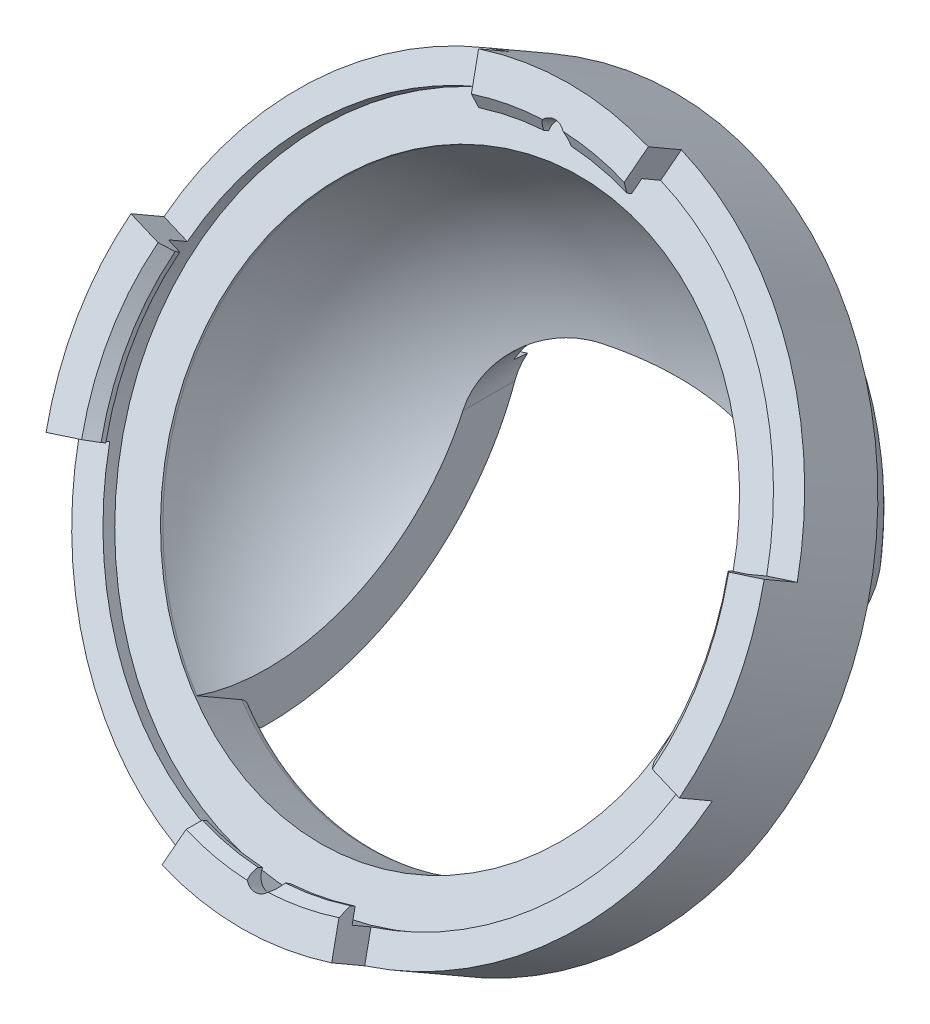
ISO-10303-21;
HEADER;
FILE_DESCRIPTION(('STEP AP214'),'2;1');
FILE_NAME('part.step','',(''),(''),'','','');
FILE_SCHEMA(('AUTOMOTIVE_DESIGN { 1 0 10303 214 1 1 1 1 }'));
ENDSEC;
DATA;
#1=APPLICATION_CONTEXT('core data for automotive mechanical design processes');
#2=APPLICATION_PROTOCOL_DEFINITION('international standard','automotive_design',2000,#1);
#3=PRODUCT_CONTEXT('',#1,'mechanical');
#4=PRODUCT('Part','Part','',(#3));
#5=PRODUCT_RELATED_PRODUCT_CATEGORY('part','',(#4));
#6=PRODUCT_DEFINITION_FORMATION('','',#4);
#7=PRODUCT_DEFINITION_CONTEXT('part definition',#1,'design');
#8=PRODUCT_DEFINITION('design','',#6,#7);
#9=PRODUCT_DEFINITION_SHAPE('','',#8);
#10=(LENGTH_UNIT() NAMED_UNIT(*) SI_UNIT(.MILLI.,.METRE.));
#11=(NAMED_UNIT(*) PLANE_ANGLE_UNIT() SI_UNIT($,.RADIAN.));
#12=(NAMED_UNIT(*) SI_UNIT($,.STERADIAN.) SOLID_ANGLE_UNIT());
#13=UNCERTAINTY_MEASURE_WITH_UNIT(LENGTH_MEASURE(1.E-05),#10,'distance_accuracy_value','');
#14=(GEOMETRIC_REPRESENTATION_CONTEXT(3) GLOBAL_UNCERTAINTY_ASSIGNED_CONTEXT((#13)) GLOBAL_UNIT_ASSIGNED_CONTEXT((#10,
#11,#12)) REPRESENTATION_CONTEXT('',''));
#15=CARTESIAN_POINT('',(0.,0.,0.));
#16=DIRECTION('',(0.,0.,1.));
#17=DIRECTION('',(1.,0.,0.));
#18=AXIS2_PLACEMENT_3D('',#15,#16,#17);
#19=CARTESIAN_POINT('',(-12.75,-3.9893920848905,-14.2378989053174));
#20=DIRECTION('',(0.,-0.5,-0.866025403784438));
#21=DIRECTION('',(-1.,0.,0.));
#22=AXIS2_PLACEMENT_3D('',#19,#20,#21);
#23=SPHERICAL_SURFACE('',#22,11.1176920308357);
#24=CARTESIAN_POINT('',(-18.2443467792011,-3.98719076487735,-14.2378989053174));
#25=DIRECTION('',(0.999999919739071,-0.000400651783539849,0.));
#26=DIRECTION('',(0.000400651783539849,0.999999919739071,0.));
#27=AXIS2_PLACEMENT_3D('',#24,#25,#26);
#28=CIRCLE('',#27,9.66515518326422);
#29=CARTESIAN_POINT('',(-18.2456627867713,-7.27185719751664,-23.3277938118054));
#30=VERTEX_POINT('',#29);
#31=CARTESIAN_POINT('',(-18.2482182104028,-13.6500228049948,-14.0260341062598));
#32=VERTEX_POINT('',#31);
#33=EDGE_CURVE('E565',#30,#32,#28,.F.);
#34=ORIENTED_EDGE('',*,*,#33,.T.);
#35=CARTESIAN_POINT('',(-12.75,-6.31280961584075,-18.2621761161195));
#36=DIRECTION('',(0.,0.5,0.866025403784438));
#37=DIRECTION('',(0.,-0.866025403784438,0.500000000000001));
#38=AXIS2_PLACEMENT_3D('',#35,#36,#37);
#39=CIRCLE('',#38,10.1);
#40=CARTESIAN_POINT('',(-22.8248295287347,-5.69567310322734,-18.6184800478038));
#41=VERTEX_POINT('',#40);
#42=EDGE_CURVE('E954',#32,#41,#39,.F.);
#43=ORIENTED_EDGE('',*,*,#42,.T.);
#44=CARTESIAN_POINT('',(-12.75,-4.97708042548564,-14.0814644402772));
#45=DIRECTION('',(0.,-0.987688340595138,0.156434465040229));
#46=DIRECTION('',(0.,-0.156434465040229,-0.987688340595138));
#47=AXIS2_PLACEMENT_3D('',#44,#45,#46);
#48=CIRCLE('',#47,11.0726273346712);
#49=CARTESIAN_POINT('',(-18.1073502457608,-6.49297700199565,-23.6524587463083));
#50=VERTEX_POINT('',#49);
#51=EDGE_CURVE('E820',#50,#41,#48,.F.);
#52=ORIENTED_EDGE('',*,*,#51,.F.);
#53=CARTESIAN_POINT('',(-17.5031018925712,-5.5616253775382,-24.1645892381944));
#54=CARTESIAN_POINT('',(-17.5641274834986,-5.62202284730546,-24.125802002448));
#55=CARTESIAN_POINT('',(-17.6221995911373,-5.68511816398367,-24.0866607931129));
#56=CARTESIAN_POINT('',(-17.7319084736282,-5.81655085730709,-24.007958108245));
#57=CARTESIAN_POINT('',(-17.783539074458,-5.88489316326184,-23.9683962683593));
#58=CARTESIAN_POINT('',(-17.9153511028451,-6.07903223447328,-23.8598796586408));
#59=CARTESIAN_POINT('',(-17.9883408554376,-6.20987870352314,-23.7908664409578));
#60=CARTESIAN_POINT('',(-18.0796387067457,-6.41711489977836,-23.6883669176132));
#61=CARTESIAN_POINT('',(-18.1072815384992,-6.48906222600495,-23.6539164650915));
#62=CARTESIAN_POINT('',(-18.1554374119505,-6.63579786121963,-23.58605166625));
#63=CARTESIAN_POINT('',(-18.1759516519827,-6.71058569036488,-23.5526371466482));
#64=CARTESIAN_POINT('',(-18.2099973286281,-6.86535824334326,-23.4860330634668));
#65=CARTESIAN_POINT('',(-18.2232348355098,-6.94543251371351,-23.4528999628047));
#66=CARTESIAN_POINT('',(-18.2410646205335,-7.10744849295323,-23.3886755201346));
#67=CARTESIAN_POINT('',(-18.2456464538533,-7.18939233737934,-23.3575866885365));
#68=CARTESIAN_POINT('',(-18.2456627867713,-7.27185719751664,-23.3277938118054));
#69=B_SPLINE_CURVE_WITH_KNOTS('',3,(#53,#54,#55,#56,#57,#58,#59,#60,#61,#62,#63,#64,#65,#66,#67,
#68),.UNSPECIFIED.,.F.,.F.,(4,2,2,2,2,2,2,4),(0.,0.282468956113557,0.565206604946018,
1.05744374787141,1.31043357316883,1.56338084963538,1.82590933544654,2.08875441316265),.UNSPECIFIED.);
#70=EDGE_CURVE('E896',#50,#30,#69,.T.);
#71=ORIENTED_EDGE('',*,*,#70,.T.);
#72=EDGE_LOOP('',(#34,#43,#52,#71));
#73=FACE_BOUND('',#72,.T.);
#74=ADVANCED_FACE('F76',(#73),#23,.T.);
#75=CARTESIAN_POINT('',(-12.75,-4.97708042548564,-14.0814644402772));
#76=DIRECTION('',(0.,-0.987688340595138,0.156434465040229));
#77=DIRECTION('',(0.,-0.156434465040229,-0.987688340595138));
#78=AXIS2_PLACEMENT_3D('',#75,#76,#77);
#79=CIRCLE('',#78,11.0726273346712);
#80=CARTESIAN_POINT('',(-2.67517047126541,-5.69567310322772,-18.6184800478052));
#81=VERTEX_POINT('',#80);
#82=CARTESIAN_POINT('',(-7.38424004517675,-6.49224893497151,-23.6478619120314));
#83=VERTEX_POINT('',#82);
#84=EDGE_CURVE('E819',#81,#83,#79,.F.);
#85=ORIENTED_EDGE('',*,*,#84,.F.);
#86=CARTESIAN_POINT('',(-12.75,-6.31280961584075,-18.2621761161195));
#87=DIRECTION('',(0.,0.5,0.866025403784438));
#88=DIRECTION('',(0.,-0.866025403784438,0.500000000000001));
#89=AXIS2_PLACEMENT_3D('',#86,#87,#88);
#90=CIRCLE('',#89,10.1);
#91=CARTESIAN_POINT('',(-7.24821674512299,-13.6480182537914,-14.0271914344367));
#92=VERTEX_POINT('',#91);
#93=EDGE_CURVE('E952',#81,#92,#90,.F.);
#94=ORIENTED_EDGE('',*,*,#93,.T.);
#95=CARTESIAN_POINT('',(-7.2443478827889,-3.99159793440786,-14.2378989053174));
#96=DIRECTION('',(-0.999999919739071,0.000400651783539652,0.));
#97=DIRECTION('',(-0.000400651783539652,-0.999999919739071,0.));
#98=AXIS2_PLACEMENT_3D('',#95,#96,#97);
#99=CIRCLE('',#98,9.65871968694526);
#100=CARTESIAN_POINT('',(-7.24566284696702,-7.27366013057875,-23.3218920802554));
#101=VERTEX_POINT('',#100);
#102=EDGE_CURVE('E563',#92,#101,#99,.F.);
#103=ORIENTED_EDGE('',*,*,#102,.T.);
#104=CARTESIAN_POINT('',(-7.24566284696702,-7.27366013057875,-23.3218920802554));
#105=CARTESIAN_POINT('',(-7.24562606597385,-7.20427523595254,-23.3469575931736));
#106=CARTESIAN_POINT('',(-7.24881628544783,-7.135248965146,-23.3729461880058));
#107=CARTESIAN_POINT('',(-7.2613857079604,-6.99841557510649,-23.4264454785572));
#108=CARTESIAN_POINT('',(-7.27076029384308,-6.93060758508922,-23.4539550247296));
#109=CARTESIAN_POINT('',(-7.29542954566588,-6.79663287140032,-23.5101999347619));
#110=CARTESIAN_POINT('',(-7.31072199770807,-6.73046554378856,-23.5389348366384));
#111=CARTESIAN_POINT('',(-7.34691527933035,-6.60011855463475,-23.5973482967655));
#112=CARTESIAN_POINT('',(-7.36781704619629,-6.53593922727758,-23.6270270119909));
#113=CARTESIAN_POINT('',(-7.43895217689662,-6.34557296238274,-23.7176868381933));
#114=CARTESIAN_POINT('',(-7.49736544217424,-6.2228696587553,-23.7797359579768));
#115=CARTESIAN_POINT('',(-7.63318062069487,-5.98886656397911,-23.9046236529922));
#116=CARTESIAN_POINT('',(-7.71059722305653,-5.87757568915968,-23.9674628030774));
#117=CARTESIAN_POINT('',(-7.82632520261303,-5.7358267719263,-24.0518298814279));
#118=CARTESIAN_POINT('',(-7.85753504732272,-5.69965241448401,-24.0737841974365));
#119=CARTESIAN_POINT('',(-7.92180349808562,-5.6290519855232,-24.117466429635));
#120=CARTESIAN_POINT('',(-7.95485701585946,-5.5946215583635,-24.1391947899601));
#121=CARTESIAN_POINT('',(-7.98882796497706,-5.56102771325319,-24.1608157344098));
#122=B_SPLINE_CURVE_WITH_KNOTS('',3,(#104,#105,#106,#107,#108,#109,#110,#111,#112,#113,#114,
#115,#116,#117,#118,#119,#120,#121),.UNSPECIFIED.,.F.,.F.,(4,2,2,2,2,2,2,2,4),(0.,
0.221206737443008,0.442248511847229,0.663207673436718,0.884203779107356,1.33048508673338,
1.77711245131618,1.9348060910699,2.0920842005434),.UNSPECIFIED.);
#123=EDGE_CURVE('E638',#101,#83,#122,.T.);
#124=ORIENTED_EDGE('',*,*,#123,.T.);
#125=EDGE_LOOP('',(#85,#94,#103,#124));
#126=FACE_BOUND('',#125,.T.);
#127=ADVANCED_FACE('F528',(#126),#23,.T.);
#128=CARTESIAN_POINT('',(-18.2456627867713,-7.27185719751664,-34.0748175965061));
#129=DIRECTION('',(0.999999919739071,-0.000400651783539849,0.));
#130=DIRECTION('',(0.000400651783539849,0.999999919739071,0.));
#131=AXIS2_PLACEMENT_3D('',#128,#129,#130);
#132=PLANE('',#131);
#133=CARTESIAN_POINT('',(-18.2477169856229,-12.3989994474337,-13.3085916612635));
#134=CARTESIAN_POINT('',(-18.2477228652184,-12.4136745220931,-13.3341248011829));
#135=CARTESIAN_POINT('',(-18.2477296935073,-12.4307174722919,-13.3582371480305));
#136=CARTESIAN_POINT('',(-18.2477448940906,-12.4686571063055,-13.4029814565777));
#137=CARTESIAN_POINT('',(-18.2477532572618,-12.4895310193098,-13.4236326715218));
#138=CARTESIAN_POINT('',(-18.2477712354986,-12.5344034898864,-13.4610933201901));
#139=CARTESIAN_POINT('',(-18.247780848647,-12.5583972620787,-13.4779085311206));
#140=CARTESIAN_POINT('',(-18.2478010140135,-12.6087286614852,-13.5076004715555));
#141=CARTESIAN_POINT('',(-18.2478115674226,-12.6350692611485,-13.5204721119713));
#142=CARTESIAN_POINT('',(-18.2478340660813,-12.6912244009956,-13.5430387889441));
#143=CARTESIAN_POINT('',(-18.2478460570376,-12.7211530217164,-13.5524477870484));
#144=CARTESIAN_POINT('',(-18.2478704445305,-12.7820225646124,-13.5669332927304));
#145=CARTESIAN_POINT('',(-18.2478828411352,-12.8129636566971,-13.5720090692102));
#146=CARTESIAN_POINT('',(-18.2479099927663,-12.8807323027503,-13.5786066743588));
#147=CARTESIAN_POINT('',(-18.2479247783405,-12.9176361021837,-13.5793443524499));
#148=CARTESIAN_POINT('',(-18.2479542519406,-12.9912002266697,-13.5755684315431));
#149=CARTESIAN_POINT('',(-18.2479689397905,-13.027860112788,-13.5710470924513));
#150=CARTESIAN_POINT('',(-18.2480019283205,-13.110197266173,-13.5551983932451));
#151=CARTESIAN_POINT('',(-18.24802011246,-13.1555836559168,-13.5423419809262));
#152=CARTESIAN_POINT('',(-18.2480553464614,-13.2435253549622,-13.5093581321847));
#153=CARTESIAN_POINT('',(-18.248072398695,-13.2860865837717,-13.4892465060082));
#154=CARTESIAN_POINT('',(-18.2480886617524,-13.3266780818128,-13.4658164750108));
#155=B_SPLINE_CURVE_WITH_KNOTS('',3,(#133,#134,#135,#136,#137,#138,#139,#140,#141,#142,#143,
#144,#145,#146,#147,#148,#149,#150,#151,#152,#153,#154),.UNSPECIFIED.,.F.,.F.,(4,2,2,2,2,2,2,2,
2,2,4),(0.,0.0881514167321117,0.175794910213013,0.26330552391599,0.350928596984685,
0.444695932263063,0.538479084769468,0.648793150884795,0.759269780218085,0.900110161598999,
1.04064546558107),.UNSPECIFIED.);
#156=CARTESIAN_POINT('',(-18.2477169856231,-12.3989994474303,-13.3085916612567));
#157=VERTEX_POINT('',#156);
#158=CARTESIAN_POINT('',(-18.2480886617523,-13.3266780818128,-13.4658164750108));
#159=VERTEX_POINT('',#158);
#160=EDGE_CURVE('E512',#157,#159,#155,.T.);
#161=ORIENTED_EDGE('',*,*,#160,.T.);
#162=CARTESIAN_POINT('',(-12.7499999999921,13709.5330379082,23738.2797005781));
#163=DIRECTION('',(0.999999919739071,-0.000400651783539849,0.));
#164=DIRECTION('',(0.000200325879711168,0.499999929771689,0.866025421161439));
#165=AXIS2_PLACEMENT_3D('',#162,#163,#164);
#166=ELLIPSE('',#165,50417.846194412,10.1);
#167=EDGE_CURVE('E944',#159,#32,#166,.T.);
#168=ORIENTED_EDGE('',*,*,#167,.T.);
#169=ORIENTED_EDGE('',*,*,#33,.F.);
#170=DIRECTION('',(0.,0.,1.));
#171=VECTOR('',#170,1.);
#172=CARTESIAN_POINT('',(-18.2456627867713,-7.27185719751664,-34.0748175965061));
#173=LINE('',#172,#171);
#174=CARTESIAN_POINT('',(-18.2456627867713,-7.27185719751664,-21.4158591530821));
#175=VERTEX_POINT('',#174);
#176=EDGE_CURVE('E599',#30,#175,#173,.T.);
#177=ORIENTED_EDGE('',*,*,#176,.T.);
#178=CARTESIAN_POINT('',(-18.2443467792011,-3.98719076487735,-14.2378989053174));
#179=DIRECTION('',(0.999999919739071,-0.000400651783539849,0.));
#180=DIRECTION('',(0.000400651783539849,0.999999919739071,0.));
#181=AXIS2_PLACEMENT_3D('',#178,#179,#180);
#182=CIRCLE('',#181,7.89380444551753);
#183=CARTESIAN_POINT('',(-18.2473364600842,-11.4492332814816,-11.6630083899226));
#184=VERTEX_POINT('',#183);
#185=EDGE_CURVE('E606',#184,#175,#182,.T.);
#186=ORIENTED_EDGE('',*,*,#185,.F.);
#187=CARTESIAN_POINT('',(-12.7499999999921,13709.5330379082,23738.2797005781));
#188=DIRECTION('',(0.999999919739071,-0.000400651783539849,0.));
#189=DIRECTION('',(0.000200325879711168,0.499999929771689,0.866025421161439));
#190=AXIS2_PLACEMENT_3D('',#187,#188,#189);
#191=ELLIPSE('',#190,47422.7266185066,9.50000000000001);
#192=EDGE_CURVE('E490',#157,#184,#191,.F.);
#193=ORIENTED_EDGE('',*,*,#192,.F.);
#194=EDGE_LOOP('',(#161,#168,#169,#177,#186,#193));
#195=FACE_BOUND('',#194,.T.);
#196=ADVANCED_FACE('F522',(#195),#132,.T.);
#197=CARTESIAN_POINT('',(-7.24566284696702,-7.27366013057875,-34.0737766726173));
#198=DIRECTION('',(-0.999999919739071,0.000400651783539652,0.));
#199=DIRECTION('',(-0.000400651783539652,-0.999999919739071,0.));
#200=AXIS2_PLACEMENT_3D('',#197,#198,#199);
#201=PLANE('',#200);
#202=ORIENTED_EDGE('',*,*,#102,.F.);
#203=CARTESIAN_POINT('',(-12.7500000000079,-13745.7291903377,-23815.6294138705));
#204=DIRECTION('',(-0.999999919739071,0.000400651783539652,0.));
#205=DIRECTION('',(0.000200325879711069,0.499999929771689,0.866025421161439));
#206=AXIS2_PLACEMENT_3D('',#203,#204,#205);
#207=ELLIPSE('',#206,50417.8461944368,10.1);
#208=CARTESIAN_POINT('',(-7.24808713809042,-13.3245278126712,-13.4670579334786));
#209=VERTEX_POINT('',#208);
#210=EDGE_CURVE('E947',#92,#209,#207,.T.);
#211=ORIENTED_EDGE('',*,*,#210,.T.);
#212=CARTESIAN_POINT('',(-7.24808713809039,-13.3245278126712,-13.4670579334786));
#213=CARTESIAN_POINT('',(-7.24806948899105,-13.2804768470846,-13.4924791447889));
#214=CARTESIAN_POINT('',(-7.24805091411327,-13.2341152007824,-13.5140044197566));
#215=CARTESIAN_POINT('',(-7.24801237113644,-13.1379145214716,-13.548579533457));
#216=CARTESIAN_POINT('',(-7.24799239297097,-13.0880503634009,-13.5615593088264));
#217=CARTESIAN_POINT('',(-7.24795320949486,-12.9902510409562,-13.5773554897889));
#218=CARTESIAN_POINT('',(-7.24793404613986,-12.9424205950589,-13.5808120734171));
#219=CARTESIAN_POINT('',(-7.24789585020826,-12.8470861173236,-13.578536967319));
#220=CARTESIAN_POINT('',(-7.24787681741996,-12.7995815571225,-13.5728436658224));
#221=CARTESIAN_POINT('',(-7.24784530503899,-12.7209287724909,-13.5547213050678));
#222=CARTESIAN_POINT('',(-7.24783258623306,-12.6891834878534,-13.5448538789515));
#223=CARTESIAN_POINT('',(-7.24780795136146,-12.6276965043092,-13.5200420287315));
#224=CARTESIAN_POINT('',(-7.24779603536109,-12.5979549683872,-13.505097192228));
#225=CARTESIAN_POINT('',(-7.2477733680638,-12.5413789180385,-13.4699678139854));
#226=CARTESIAN_POINT('',(-7.24776262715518,-12.5145703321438,-13.4497411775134));
#227=CARTESIAN_POINT('',(-7.24774294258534,-12.4654389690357,-13.4044640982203));
#228=CARTESIAN_POINT('',(-7.2477339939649,-12.4431038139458,-13.3794273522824));
#229=CARTESIAN_POINT('',(-7.24772419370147,-12.4186430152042,-13.3456405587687));
#230=CARTESIAN_POINT('',(-7.24772229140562,-12.4138950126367,-13.3387126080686));
#231=CARTESIAN_POINT('',(-7.24771863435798,-12.4047672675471,-13.3246309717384));
#232=CARTESIAN_POINT('',(-7.24771687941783,-12.4003870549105,-13.3174775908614));
#233=CARTESIAN_POINT('',(-7.24771519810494,-12.3961906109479,-13.3102133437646));
#234=B_SPLINE_CURVE_WITH_KNOTS('',3,(#212,#213,#214,#215,#216,#217,#218,#219,#220,#221,#222,
#223,#224,#225,#226,#227,#228,#229,#230,#231,#232,#233),.UNSPECIFIED.,.F.,.F.,(4,2,2,2,2,2,2,2,
2,2,4),(0.,0.152476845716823,0.306188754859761,0.449281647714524,0.591775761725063,
0.69112210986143,0.790476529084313,0.890648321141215,0.990538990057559,1.01572848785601,
1.04088528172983),.UNSPECIFIED.);
#235=CARTESIAN_POINT('',(-7.24771519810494,-12.3961906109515,-13.3102133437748));
#236=VERTEX_POINT('',#235);
#237=EDGE_CURVE('E85',#209,#236,#234,.T.);
#238=ORIENTED_EDGE('',*,*,#237,.T.);
#239=CARTESIAN_POINT('',(-12.7500000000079,-13745.7291903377,-23815.6294138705));
#240=DIRECTION('',(-0.999999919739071,0.000400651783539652,0.));
#241=DIRECTION('',(0.000200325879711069,0.499999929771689,0.866025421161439));
#242=AXIS2_PLACEMENT_3D('',#239,#240,#241);
#243=ELLIPSE('',#242,47422.7266185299,9.50000000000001);
#244=CARTESIAN_POINT('',(-7.24733448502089,-11.4459563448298,-11.6649003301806));
#245=VERTEX_POINT('',#244);
#246=EDGE_CURVE('E487',#245,#236,#243,.F.);
#247=ORIENTED_EDGE('',*,*,#246,.F.);
#248=CARTESIAN_POINT('',(-7.2443478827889,-3.99159793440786,-14.2378989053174));
#249=DIRECTION('',(-0.999999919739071,0.000400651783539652,0.));
#250=DIRECTION('',(-0.000400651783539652,-0.999999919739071,0.));
#251=AXIS2_PLACEMENT_3D('',#248,#249,#250);
#252=CIRCLE('',#251,7.88592352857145);
#253=CARTESIAN_POINT('',(-7.24566284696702,-7.27366013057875,-21.4083839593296));
#254=VERTEX_POINT('',#253);
#255=EDGE_CURVE('E600',#254,#245,#252,.T.);
#256=ORIENTED_EDGE('',*,*,#255,.F.);
#257=DIRECTION('',(0.,0.,1.));
#258=VECTOR('',#257,1.);
#259=CARTESIAN_POINT('',(-7.24566284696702,-7.27366013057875,-34.0737766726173));
#260=LINE('',#259,#258);
#261=EDGE_CURVE('E591',#101,#254,#260,.T.);
#262=ORIENTED_EDGE('',*,*,#261,.F.);
#263=EDGE_LOOP('',(#202,#211,#238,#247,#256,#262));
#264=FACE_BOUND('',#263,.T.);
#265=ADVANCED_FACE('F527',(#264),#201,.T.);
#266=CARTESIAN_POINT('',(-12.75,-4.97708042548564,-14.0814644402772));
#267=DIRECTION('',(0.,-0.987688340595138,0.156434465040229));
#268=DIRECTION('',(0.,-0.156434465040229,-0.987688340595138));
#269=AXIS2_PLACEMENT_3D('',#266,#267,#268);
#270=PLANE('',#269);
#271=CARTESIAN_POINT('',(-12.75,-5.38460613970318,-16.6544805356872));
#272=DIRECTION('',(0.,-0.987688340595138,0.156434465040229));
#273=DIRECTION('',(0.,0.156434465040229,0.987688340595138));
#274=AXIS2_PLACEMENT_3D('',#271,#272,#273);
#275=ELLIPSE('',#274,28.1833239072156,10.1);
#276=CARTESIAN_POINT('',(-22.8393218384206,-5.58728683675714,-17.9341560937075));
#277=VERTEX_POINT('',#276);
#278=EDGE_CURVE('E936',#277,#41,#275,.T.);
#279=ORIENTED_EDGE('',*,*,#278,.F.);
#280=DIRECTION('',(1.,0.,0.));
#281=VECTOR('',#280,1.);
#282=CARTESIAN_POINT('',(-12.75,-5.58728683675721,-17.9341560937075));
#283=LINE('',#282,#281);
#284=CARTESIAN_POINT('',(-22.580917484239,-5.58728683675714,-17.9341560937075));
#285=VERTEX_POINT('',#284);
#286=EDGE_CURVE('E860',#277,#285,#283,.T.);
#287=ORIENTED_EDGE('',*,*,#286,.T.);
#288=CARTESIAN_POINT('',(-12.75,-4.97708042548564,-14.0814644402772));
#289=DIRECTION('',(0.,0.987688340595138,-0.156434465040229));
#290=DIRECTION('',(0.,-0.156434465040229,-0.987688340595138));
#291=AXIS2_PLACEMENT_3D('',#288,#289,#290);
#292=CIRCLE('',#291,10.5765080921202);
#293=CARTESIAN_POINT('',(-18.0740748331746,-6.40669588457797,-23.1077012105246));
#294=VERTEX_POINT('',#293);
#295=EDGE_CURVE('E843',#294,#285,#292,.T.);
#296=ORIENTED_EDGE('',*,*,#295,.F.);
#297=CARTESIAN_POINT('',(-17.9904149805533,-6.22406791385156,-21.9546335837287));
#298=CARTESIAN_POINT('',(-18.0037287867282,-6.25020488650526,-22.11965593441));
#299=CARTESIAN_POINT('',(-18.0164538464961,-6.27634914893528,-22.2847243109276));
#300=CARTESIAN_POINT('',(-18.0407662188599,-6.32864843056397,-22.6149289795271));
#301=CARTESIAN_POINT('',(-18.0523536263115,-6.35480344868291,-22.780065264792));
#302=CARTESIAN_POINT('',(-18.0744322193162,-6.40712376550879,-23.1104027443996));
#303=CARTESIAN_POINT('',(-18.084923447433,-6.43328906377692,-23.275603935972));
#304=CARTESIAN_POINT('',(-18.1048439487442,-6.48562945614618,-23.6060681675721));
#305=CARTESIAN_POINT('',(-18.1142732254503,-6.51180455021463,-23.7713312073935));
#306=CARTESIAN_POINT('',(-18.1321000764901,-6.56416442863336,-24.101918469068));
#307=CARTESIAN_POINT('',(-18.1404976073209,-6.59034921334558,-24.2672426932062));
#308=CARTESIAN_POINT('',(-18.1562857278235,-6.64272829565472,-24.5979512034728));
#309=CARTESIAN_POINT('',(-18.1636762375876,-6.66892259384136,-24.7633354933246));
#310=CARTESIAN_POINT('',(-18.1705751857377,-6.69512003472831,-24.9287396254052));
#311=B_SPLINE_CURVE_WITH_KNOTS('',3,(#297,#298,#299,#300,#301,#302,#303,#304,#305,#306,#307,
#308,#309,#310),.UNSPECIFIED.,.F.,.F.,(4,2,2,2,2,2,4),(0.,0.502825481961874,1.00560900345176,
1.5083729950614,2.01113532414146,2.51391884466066,3.01674223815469),.UNSPECIFIED.);
#312=EDGE_CURVE('E814',#294,#50,#311,.T.);
#313=ORIENTED_EDGE('',*,*,#312,.T.);
#314=ORIENTED_EDGE('',*,*,#51,.T.);
#315=EDGE_LOOP('',(#279,#287,#296,#313,#314));
#316=FACE_BOUND('',#315,.T.);
#317=ADVANCED_FACE('F805',(#316),#270,.F.);
#318=CARTESIAN_POINT('',(-12.75,-5.38460613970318,-16.6544805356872));
#319=DIRECTION('',(0.,-0.987688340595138,0.156434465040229));
#320=DIRECTION('',(0.,0.156434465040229,0.987688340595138));
#321=AXIS2_PLACEMENT_3D('',#318,#319,#320);
#322=ELLIPSE('',#321,28.1833239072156,10.1);
#323=CARTESIAN_POINT('',(-2.66067816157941,-5.58728683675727,-17.9341560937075));
#324=VERTEX_POINT('',#323);
#325=EDGE_CURVE('E874',#81,#324,#322,.T.);
#326=ORIENTED_EDGE('',*,*,#325,.F.);
#327=ORIENTED_EDGE('',*,*,#84,.T.);
#328=CARTESIAN_POINT('',(-7.3208200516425,-6.69485576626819,-24.9270711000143));
#329=CARTESIAN_POINT('',(-7.32772624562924,-6.66864343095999,-24.761572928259));
#330=CARTESIAN_POINT('',(-7.33512459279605,-6.64243424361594,-24.5960946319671));
#331=CARTESIAN_POINT('',(-7.35092962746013,-6.59002540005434,-24.2651982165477));
#332=CARTESIAN_POINT('',(-7.35933623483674,-6.56382574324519,-24.099780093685));
#333=CARTESIAN_POINT('',(-7.37718253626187,-6.51143613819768,-23.769005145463));
#334=CARTESIAN_POINT('',(-7.38662218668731,-6.48524618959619,-23.6036483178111));
#335=CARTESIAN_POINT('',(-7.40656480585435,-6.4328761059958,-23.2729966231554));
#336=CARTESIAN_POINT('',(-7.41706777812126,-6.40669597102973,-23.107701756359));
#337=CARTESIAN_POINT('',(-7.43917131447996,-6.35434600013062,-22.7771770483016));
#338=CARTESIAN_POINT('',(-7.45077192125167,-6.32817616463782,-22.6119472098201));
#339=CARTESIAN_POINT('',(-7.47511225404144,-6.2758472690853,-22.2815555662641));
#340=CARTESIAN_POINT('',(-7.48785207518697,-6.24968821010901,-22.1163937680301));
#341=CARTESIAN_POINT('',(-7.50118147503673,-6.22353645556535,-21.9512780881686));
#342=B_SPLINE_CURVE_WITH_KNOTS('',3,(#328,#329,#330,#331,#332,#333,#334,#335,#336,#337,#338,
#339,#340,#341),.UNSPECIFIED.,.F.,.F.,(4,2,2,2,2,2,4),(0.,0.503109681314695,1.00617940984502,
1.50922790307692,2.01227806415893,2.51534779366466,3.01845957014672),.UNSPECIFIED.);
#343=CARTESIAN_POINT('',(-7.41756244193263,-6.40593293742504,-23.1028841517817));
#344=VERTEX_POINT('',#343);
#345=EDGE_CURVE('E627',#83,#344,#342,.T.);
#346=ORIENTED_EDGE('',*,*,#345,.T.);
#347=CARTESIAN_POINT('',(-2.91908251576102,-5.58728683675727,-17.9341560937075));
#348=VERTEX_POINT('',#347);
#349=EDGE_CURVE('E830',#348,#344,#292,.T.);
#350=ORIENTED_EDGE('',*,*,#349,.F.);
#351=DIRECTION('',(1.,0.,0.));
#352=VECTOR('',#351,1.);
#353=CARTESIAN_POINT('',(-12.75,-5.58728683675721,-17.9341560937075));
#354=LINE('',#353,#352);
#355=EDGE_CURVE('E495',#348,#324,#354,.T.);
#356=ORIENTED_EDGE('',*,*,#355,.T.);
#357=EDGE_LOOP('',(#326,#327,#346,#350,#356));
#358=FACE_BOUND('',#357,.T.);
#359=ADVANCED_FACE('F800',(#358),#270,.F.);
#360=CARTESIAN_POINT('',(-12.75,-3.73939208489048,-13.8048862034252));
#361=DIRECTION('',(0.,0.5,0.866025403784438));
#362=DIRECTION('',(0.,-0.866025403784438,0.5));
#363=AXIS2_PLACEMENT_3D('',#360,#361,#362);
#364=PLANE('',#363);
#365=CARTESIAN_POINT('',(-12.75,-3.73939208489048,-13.8048862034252));
#366=DIRECTION('',(0.,0.5,0.866025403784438));
#367=DIRECTION('',(0.,-0.866025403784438,0.5));
#368=AXIS2_PLACEMENT_3D('',#365,#366,#367);
#369=CIRCLE('',#368,10.8356398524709);
#370=CARTESIAN_POINT('',(-9.94553004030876,-12.8035814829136,-8.57167401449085));
#371=VERTEX_POINT('',#370);
#372=CARTESIAN_POINT('',(-12.3735780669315,-13.1176674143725,-8.39033641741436));
#373=VERTEX_POINT('',#372);
#374=EDGE_CURVE('E669',#371,#373,#369,.F.);
#375=ORIENTED_EDGE('',*,*,#374,.T.);
#376=CARTESIAN_POINT('',(-12.7500000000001,-12.8326588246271,-8.55488620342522));
#377=DIRECTION('',(0.,0.5,0.866025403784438));
#378=DIRECTION('',(0.,-0.866025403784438,0.5));
#379=AXIS2_PLACEMENT_3D('',#376,#377,#378);
#380=CIRCLE('',#379,0.5);
#381=CARTESIAN_POINT('',(-13.1264219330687,-13.1176674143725,-8.39033641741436));
#382=VERTEX_POINT('',#381);
#383=EDGE_CURVE('E967',#373,#382,#380,.F.);
#384=ORIENTED_EDGE('',*,*,#383,.T.);
#385=CARTESIAN_POINT('',(-15.5544699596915,-12.8035814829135,-8.57167401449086));
#386=VERTEX_POINT('',#385);
#387=EDGE_CURVE('E668',#382,#386,#369,.F.);
#388=ORIENTED_EDGE('',*,*,#387,.T.);
#389=DIRECTION('',(0.258819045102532,0.836516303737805,-0.482962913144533));
#390=VECTOR('',#389,1.);
#391=CARTESIAN_POINT('',(-15.3379015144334,-12.1036212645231,-8.97579623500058));
#392=LINE('',#391,#390);
#393=CARTESIAN_POINT('',(-15.8621681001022,-13.7980775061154,-7.99750146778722));
#394=VERTEX_POINT('',#393);
#395=EDGE_CURVE('E452',#394,#386,#392,.T.);
#396=ORIENTED_EDGE('',*,*,#395,.F.);
#397=CARTESIAN_POINT('',(-12.75,-3.73939208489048,-13.8048862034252));
#398=DIRECTION('',(0.,0.5,0.866025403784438));
#399=DIRECTION('',(0.,-0.866025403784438,0.5));
#400=AXIS2_PLACEMENT_3D('',#397,#398,#399);
#401=CIRCLE('',#400,12.0244941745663);
#402=CARTESIAN_POINT('',(-9.63783189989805,-13.7980775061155,-7.9975014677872));
#403=VERTEX_POINT('',#402);
#404=EDGE_CURVE('E858',#394,#403,#401,.T.);
#405=ORIENTED_EDGE('',*,*,#404,.T.);
#406=DIRECTION('',(0.258819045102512,-0.83651630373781,0.482962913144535));
#407=VECTOR('',#406,1.);
#408=CARTESIAN_POINT('',(-10.1620984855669,-12.1036212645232,-8.97579623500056));
#409=LINE('',#408,#407);
#410=EDGE_CURVE('E1054',#371,#403,#409,.T.);
#411=ORIENTED_EDGE('',*,*,#410,.F.);
#412=EDGE_LOOP('',(#375,#384,#388,#396,#405,#411));
#413=FACE_BOUND('',#412,.T.);
#414=ADVANCED_FACE('F727',(#413),#364,.T.);
#415=CARTESIAN_POINT('',(-12.75,-4.03939208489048,-14.3245014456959));
#416=DIRECTION('',(0.,0.5,0.866025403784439));
#417=DIRECTION('',(0.,0.866025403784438,-0.5));
#418=AXIS2_PLACEMENT_3D('',#415,#416,#417);
#419=PLANE('',#418);
#420=CARTESIAN_POINT('',(-12.7500000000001,-13.1326588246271,-9.07450144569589));
#421=DIRECTION('',(0.,0.5,0.866025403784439));
#422=DIRECTION('',(0.,-0.866025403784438,0.5));
#423=AXIS2_PLACEMENT_3D('',#420,#421,#422);
#424=CIRCLE('',#423,0.5);
#425=CARTESIAN_POINT('',(-12.7500000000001,-13.5656715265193,-8.82450144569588));
#426=VERTEX_POINT('',#425);
#427=CARTESIAN_POINT('',(-13.2498582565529,-13.1223489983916,-9.08045382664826));
#428=VERTEX_POINT('',#427);
#429=EDGE_CURVE('E972',#426,#428,#424,.F.);
#430=ORIENTED_EDGE('',*,*,#429,.F.);
#431=CARTESIAN_POINT('',(-12.75,-4.03939208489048,-14.3245014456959));
#432=DIRECTION('',(0.,0.5,0.866025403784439));
#433=DIRECTION('',(0.,-0.866025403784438,0.5));
#434=AXIS2_PLACEMENT_3D('',#431,#432,#433);
#435=CIRCLE('',#434,11.);
#436=CARTESIAN_POINT('',(-15.5970094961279,-13.2410714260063,-9.01190940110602));
#437=VERTEX_POINT('',#436);
#438=EDGE_CURVE('E1014',#426,#437,#435,.F.);
#439=ORIENTED_EDGE('',*,*,#438,.T.);
#440=DIRECTION('',(-0.25881904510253,-0.836516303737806,0.482962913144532));
#441=VECTOR('',#440,1.);
#442=CARTESIAN_POINT('',(-15.4675999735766,-12.8228132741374,-9.25339085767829));
#443=LINE('',#442,#441);
#444=CARTESIAN_POINT('',(-15.4675999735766,-12.8228132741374,-9.25339085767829));
#445=VERTEX_POINT('',#444);
#446=EDGE_CURVE('E1007',#445,#437,#443,.T.);
#447=ORIENTED_EDGE('',*,*,#446,.F.);
#448=CARTESIAN_POINT('',(-12.75,-4.03939208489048,-14.3245014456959));
#449=DIRECTION('',(0.,-0.5,-0.866025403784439));
#450=DIRECTION('',(0.,0.866025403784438,-0.5));
#451=AXIS2_PLACEMENT_3D('',#448,#449,#450);
#452=CIRCLE('',#451,10.5);
#453=EDGE_CURVE('E1003',#428,#445,#452,.T.);
#454=ORIENTED_EDGE('',*,*,#453,.F.);
#455=EDGE_LOOP('',(#430,#439,#447,#454));
#456=FACE_BOUND('',#455,.T.);
#457=ADVANCED_FACE('F723',(#456),#419,.F.);
#458=CARTESIAN_POINT('',(-12.2501417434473,-13.1223489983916,-9.08045382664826));
#459=VERTEX_POINT('',#458);
#460=EDGE_CURVE('E970',#459,#426,#424,.F.);
#461=ORIENTED_EDGE('',*,*,#460,.F.);
#462=CARTESIAN_POINT('',(-10.0324000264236,-12.8228132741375,-9.25339085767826));
#463=VERTEX_POINT('',#462);
#464=EDGE_CURVE('E1004',#463,#459,#452,.T.);
#465=ORIENTED_EDGE('',*,*,#464,.F.);
#466=DIRECTION('',(-0.258819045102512,0.836516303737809,-0.482962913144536));
#467=VECTOR('',#466,1.);
#468=CARTESIAN_POINT('',(-9.63783189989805,-14.0980775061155,-8.51711671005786));
#469=LINE('',#468,#467);
#470=CARTESIAN_POINT('',(-9.90299050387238,-13.2410714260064,-9.01190940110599));
#471=VERTEX_POINT('',#470);
#472=EDGE_CURVE('E1001',#471,#463,#469,.T.);
#473=ORIENTED_EDGE('',*,*,#472,.F.);
#474=EDGE_CURVE('E429',#471,#426,#435,.F.);
#475=ORIENTED_EDGE('',*,*,#474,.T.);
#476=EDGE_LOOP('',(#461,#465,#473,#475));
#477=FACE_BOUND('',#476,.T.);
#478=ADVANCED_FACE('F726',(#477),#419,.F.);
#479=CARTESIAN_POINT('',(-12.75,-4.03939208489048,-14.3245014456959));
#480=DIRECTION('',(0.,0.5,0.866025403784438));
#481=DIRECTION('',(0.,-0.866025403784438,0.5));
#482=AXIS2_PLACEMENT_3D('',#479,#480,#481);
#483=CYLINDRICAL_SURFACE('',#482,10.5);
#484=ORIENTED_EDGE('',*,*,#464,.T.);
#485=DIRECTION('',(0.,-0.5,-0.866025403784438));
#486=VECTOR('',#485,1.);
#487=CARTESIAN_POINT('',(-12.2501417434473,-7.61559028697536,0.457532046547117));
#488=LINE('',#487,#486);
#489=CARTESIAN_POINT('',(-12.2501417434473,-13.0223489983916,-8.90724874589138));
#490=VERTEX_POINT('',#489);
#491=EDGE_CURVE('E965',#490,#459,#488,.T.);
#492=ORIENTED_EDGE('',*,*,#491,.F.);
#493=CARTESIAN_POINT('',(-12.75,-3.93939208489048,-14.151296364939));
#494=DIRECTION('',(0.,0.499999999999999,0.866025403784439));
#495=DIRECTION('',(0.,-0.866025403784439,0.499999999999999));
#496=AXIS2_PLACEMENT_3D('',#493,#494,#495);
#497=CIRCLE('',#496,10.5);
#498=CARTESIAN_POINT('',(-10.0324000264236,-12.7228132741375,-9.0801857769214));
#499=VERTEX_POINT('',#498);
#500=EDGE_CURVE('E674',#490,#499,#497,.T.);
#501=ORIENTED_EDGE('',*,*,#500,.T.);
#502=DIRECTION('',(0.,0.5,0.866025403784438));
#503=VECTOR('',#502,1.);
#504=CARTESIAN_POINT('',(-10.0324000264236,-12.8228132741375,-9.25339085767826));
#505=LINE('',#504,#503);
#506=EDGE_CURVE('E1010',#463,#499,#505,.T.);
#507=ORIENTED_EDGE('',*,*,#506,.F.);
#508=EDGE_LOOP('',(#484,#492,#501,#507));
#509=FACE_BOUND('',#508,.T.);
#510=ADVANCED_FACE('F729',(#509),#483,.F.);
#511=CARTESIAN_POINT('',(-15.4675999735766,-12.7228132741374,-9.08018577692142));
#512=VERTEX_POINT('',#511);
#513=CARTESIAN_POINT('',(-13.2498582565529,-13.0223489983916,-8.90724874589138));
#514=VERTEX_POINT('',#513);
#515=EDGE_CURVE('E675',#512,#514,#497,.T.);
#516=ORIENTED_EDGE('',*,*,#515,.T.);
#517=DIRECTION('',(0.,-0.5,-0.866025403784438));
#518=VECTOR('',#517,1.);
#519=CARTESIAN_POINT('',(-13.2498582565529,-7.61559028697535,0.457532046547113));
#520=LINE('',#519,#518);
#521=EDGE_CURVE('E962',#514,#428,#520,.T.);
#522=ORIENTED_EDGE('',*,*,#521,.T.);
#523=ORIENTED_EDGE('',*,*,#453,.T.);
#524=DIRECTION('',(0.,0.5,0.866025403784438));
#525=VECTOR('',#524,1.);
#526=CARTESIAN_POINT('',(-15.4675999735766,-12.8228132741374,-9.25339085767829));
#527=LINE('',#526,#525);
#528=EDGE_CURVE('E1011',#445,#512,#527,.T.);
#529=ORIENTED_EDGE('',*,*,#528,.T.);
#530=EDGE_LOOP('',(#516,#522,#523,#529));
#531=FACE_BOUND('',#530,.T.);
#532=ADVANCED_FACE('F732',(#531),#483,.F.);
#533=CARTESIAN_POINT('',(-12.75,-3.73939208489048,-13.8048862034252));
#534=DIRECTION('',(0.,0.499999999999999,0.866025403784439));
#535=DIRECTION('',(0.,-0.866025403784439,0.499999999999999));
#536=AXIS2_PLACEMENT_3D('',#533,#534,#535);
#537=CONICAL_SURFACE('',#536,10.8356398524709,0.698131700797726);
#538=ORIENTED_EDGE('',*,*,#387,.F.);
#539=CARTESIAN_POINT('',(-13.1243867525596,-13.1183352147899,-8.38686627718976));
#540=CARTESIAN_POINT('',(-13.1350012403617,-13.1148709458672,-8.40486219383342));
#541=CARTESIAN_POINT('',(-13.1448400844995,-13.1113400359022,-8.42328301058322));
#542=CARTESIAN_POINT('',(-13.1630454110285,-13.1041828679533,-8.46079388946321));
#543=CARTESIAN_POINT('',(-13.171413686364,-13.1005567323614,-8.47988310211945));
#544=CARTESIAN_POINT('',(-13.1944428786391,-13.089590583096,-8.53789099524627));
#545=CARTESIAN_POINT('',(-13.207060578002,-13.0821518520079,-8.57760684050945));
#546=CARTESIAN_POINT('',(-13.2327447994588,-13.0632460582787,-8.67959293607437));
#547=CARTESIAN_POINT('',(-13.2425153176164,-13.0517304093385,-8.74267659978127));
#548=CARTESIAN_POINT('',(-13.2515901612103,-13.0289349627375,-8.86966472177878));
#549=CARTESIAN_POINT('',(-13.2508869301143,-13.0176553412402,-8.93356973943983));
#550=CARTESIAN_POINT('',(-13.24373348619,-13.0042319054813,-9.01094236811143));
#551=CARTESIAN_POINT('',(-13.242190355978,-13.0018204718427,-9.02489586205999));
#552=CARTESIAN_POINT('',(-13.238599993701,-12.9970326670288,-9.05270662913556));
#553=CARTESIAN_POINT('',(-13.2365540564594,-12.9946562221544,-9.06656405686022));
#554=CARTESIAN_POINT('',(-13.2342515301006,-12.9922949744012,-9.08038577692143));
#555=B_SPLINE_CURVE_WITH_KNOTS('',3,(#539,#540,#541,#542,#543,#544,#545,#546,#547,#548,#549,
#550,#551,#552,#553,#554),.UNSPECIFIED.,.F.,.F.,(4,2,2,2,2,2,2,4),(0.,0.0634899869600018,
0.126902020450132,0.253528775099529,0.447165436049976,0.640941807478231,0.683669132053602,
0.726287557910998),.UNSPECIFIED.);
#556=EDGE_CURVE('E500',#382,#514,#555,.T.);
#557=ORIENTED_EDGE('',*,*,#556,.T.);
#558=ORIENTED_EDGE('',*,*,#515,.F.);
#559=DIRECTION('',(0.166365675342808,0.154680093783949,-0.973856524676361));
#560=VECTOR('',#559,1.);
#561=CARTESIAN_POINT('',(-12.75,-10.1960984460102,-24.9882296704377));
#562=LINE('',#561,#560);
#563=EDGE_CURVE('E672',#386,#512,#562,.T.);
#564=ORIENTED_EDGE('',*,*,#563,.F.);
#565=EDGE_LOOP('',(#538,#557,#558,#564));
#566=FACE_BOUND('',#565,.T.);
#567=ADVANCED_FACE('F1441',(#566),#537,.F.);
#568=ORIENTED_EDGE('',*,*,#500,.F.);
#569=CARTESIAN_POINT('',(-12.2657484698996,-12.9922949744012,-9.08038577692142));
#570=CARTESIAN_POINT('',(-12.2602163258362,-12.9979814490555,-9.04709599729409));
#571=CARTESIAN_POINT('',(-12.2561446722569,-13.0037600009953,-9.01358386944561));
#572=CARTESIAN_POINT('',(-12.250911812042,-13.0154616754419,-8.94634483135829));
#573=CARTESIAN_POINT('',(-12.2497516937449,-13.0213848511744,-8.91261784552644));
#574=CARTESIAN_POINT('',(-12.2503266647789,-13.0331512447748,-8.84622350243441));
#575=CARTESIAN_POINT('',(-12.2519752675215,-13.0389914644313,-8.81355494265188));
#576=CARTESIAN_POINT('',(-12.2580714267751,-13.0507204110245,-8.74850048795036));
#577=CARTESIAN_POINT('',(-12.2625187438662,-13.0566091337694,-8.7161145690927));
#578=CARTESIAN_POINT('',(-12.2778752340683,-13.0719126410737,-8.63263974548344));
#579=CARTESIAN_POINT('',(-12.2910570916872,-13.0813336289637,-8.58192814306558));
#580=CARTESIAN_POINT('',(-12.3172766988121,-13.0953397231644,-8.50743273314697));
#581=CARTESIAN_POINT('',(-12.3272518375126,-13.1000433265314,-8.48257375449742));
#582=CARTESIAN_POINT('',(-12.3495919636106,-13.1093119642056,-8.43386950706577));
#583=CARTESIAN_POINT('',(-12.3619617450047,-13.1138766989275,-8.41002639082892));
#584=CARTESIAN_POINT('',(-12.3756132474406,-13.1183352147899,-8.38686627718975));
#585=B_SPLINE_CURVE_WITH_KNOTS('',3,(#569,#570,#571,#572,#573,#574,#575,#576,#577,#578,#579,
#580,#581,#582,#583,#584),.UNSPECIFIED.,.F.,.F.,(4,2,2,2,2,2,2,4),(0.,0.102627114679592,
0.205292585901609,0.304853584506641,0.404406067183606,0.563393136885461,0.644872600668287,
0.726516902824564),.UNSPECIFIED.);
#586=EDGE_CURVE('E1482',#490,#373,#585,.T.);
#587=ORIENTED_EDGE('',*,*,#586,.T.);
#588=ORIENTED_EDGE('',*,*,#374,.F.);
#589=DIRECTION('',(0.166365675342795,-0.154680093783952,0.973856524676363));
#590=VECTOR('',#589,1.);
#591=CARTESIAN_POINT('',(-12.75,-10.1960984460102,-24.9882296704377));
#592=LINE('',#591,#590);
#593=EDGE_CURVE('E678',#499,#371,#592,.T.);
#594=ORIENTED_EDGE('',*,*,#593,.F.);
#595=EDGE_LOOP('',(#568,#587,#588,#594));
#596=FACE_BOUND('',#595,.T.);
#597=ADVANCED_FACE('F1350',(#596),#537,.F.);
#598=CARTESIAN_POINT('',(-12.75,-3.73939208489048,-13.8048862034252));
#599=DIRECTION('',(0.,0.5,0.866025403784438));
#600=DIRECTION('',(0.,-0.866025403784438,0.5));
#601=AXIS2_PLACEMENT_3D('',#598,#599,#600);
#602=CIRCLE('',#601,10.8356398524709);
#603=CARTESIAN_POINT('',(-15.5544699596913,5.32479731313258,-19.0380983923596));
#604=VERTEX_POINT('',#603);
#605=CARTESIAN_POINT('',(-13.1264219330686,5.63888324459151,-19.2194359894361));
#606=VERTEX_POINT('',#605);
#607=EDGE_CURVE('E647',#604,#606,#602,.F.);
#608=ORIENTED_EDGE('',*,*,#607,.T.);
#609=CARTESIAN_POINT('',(-12.75,5.35387465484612,-19.0548862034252));
#610=DIRECTION('',(0.,0.5,0.866025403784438));
#611=DIRECTION('',(0.,-0.866025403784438,0.5));
#612=AXIS2_PLACEMENT_3D('',#609,#610,#611);
#613=CIRCLE('',#612,0.5);
#614=CARTESIAN_POINT('',(-12.3735780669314,5.63888324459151,-19.2194359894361));
#615=VERTEX_POINT('',#614);
#616=EDGE_CURVE('E978',#606,#615,#613,.F.);
#617=ORIENTED_EDGE('',*,*,#616,.T.);
#618=CARTESIAN_POINT('',(-9.94553004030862,5.32479731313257,-19.0380983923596));
#619=VERTEX_POINT('',#618);
#620=EDGE_CURVE('E651',#615,#619,#602,.F.);
#621=ORIENTED_EDGE('',*,*,#620,.T.);
#622=DIRECTION('',(-0.258819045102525,-0.836516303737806,0.482962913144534));
#623=VECTOR('',#622,1.);
#624=CARTESIAN_POINT('',(-10.1620984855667,4.62483709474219,-18.6339761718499));
#625=LINE('',#624,#623);
#626=CARTESIAN_POINT('',(-9.63783189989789,6.31929333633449,-19.6122709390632));
#627=VERTEX_POINT('',#626);
#628=EDGE_CURVE('E440',#627,#619,#625,.T.);
#629=ORIENTED_EDGE('',*,*,#628,.F.);
#630=CARTESIAN_POINT('',(-15.862168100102,6.31929333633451,-19.6122709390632));
#631=VERTEX_POINT('',#630);
#632=EDGE_CURVE('E862',#627,#631,#401,.T.);
#633=ORIENTED_EDGE('',*,*,#632,.T.);
#634=DIRECTION('',(-0.258819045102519,0.836516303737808,-0.482962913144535));
#635=VECTOR('',#634,1.);
#636=CARTESIAN_POINT('',(-15.3379015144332,4.6248370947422,-18.6339761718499));
#637=LINE('',#636,#635);
#638=EDGE_CURVE('E466',#604,#631,#637,.T.);
#639=ORIENTED_EDGE('',*,*,#638,.F.);
#640=EDGE_LOOP('',(#608,#617,#621,#629,#633,#639));
#641=FACE_BOUND('',#640,.T.);
#642=ADVANCED_FACE('F745',(#641),#364,.T.);
#643=CARTESIAN_POINT('',(-12.75,-4.03939208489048,-14.3245014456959));
#644=DIRECTION('',(0.,0.5,0.866025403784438));
#645=DIRECTION('',(0.,-0.866025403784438,0.5));
#646=AXIS2_PLACEMENT_3D('',#643,#644,#645);
#647=PLANE('',#646);
#648=CARTESIAN_POINT('',(-12.75,5.05387465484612,-19.5745014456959));
#649=DIRECTION('',(0.,0.5,0.866025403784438));
#650=DIRECTION('',(0.,-0.866025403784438,0.5));
#651=AXIS2_PLACEMENT_3D('',#648,#649,#650);
#652=CIRCLE('',#651,0.5);
#653=CARTESIAN_POINT('',(-13.2498582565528,5.04356482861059,-19.5685490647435));
#654=VERTEX_POINT('',#653);
#655=CARTESIAN_POINT('',(-12.75,5.48688735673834,-19.8245014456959));
#656=VERTEX_POINT('',#655);
#657=EDGE_CURVE('E983',#654,#656,#652,.F.);
#658=ORIENTED_EDGE('',*,*,#657,.F.);
#659=CARTESIAN_POINT('',(-12.75,-4.03939208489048,-14.3245014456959));
#660=DIRECTION('',(0.,-0.5,-0.866025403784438));
#661=DIRECTION('',(0.,-0.866025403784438,0.5));
#662=AXIS2_PLACEMENT_3D('',#659,#660,#661);
#663=CIRCLE('',#662,10.5);
#664=CARTESIAN_POINT('',(-15.4675999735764,4.74402910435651,-19.3956120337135));
#665=VERTEX_POINT('',#664);
#666=EDGE_CURVE('E1038',#665,#654,#663,.T.);
#667=ORIENTED_EDGE('',*,*,#666,.F.);
#668=DIRECTION('',(0.258819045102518,-0.836516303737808,0.482962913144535));
#669=VECTOR('',#668,1.);
#670=CARTESIAN_POINT('',(-15.862168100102,6.01929333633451,-20.1318861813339));
#671=LINE('',#670,#669);
#672=CARTESIAN_POINT('',(-15.5970094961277,5.16228725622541,-19.6370934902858));
#673=VERTEX_POINT('',#672);
#674=EDGE_CURVE('E1035',#673,#665,#671,.T.);
#675=ORIENTED_EDGE('',*,*,#674,.F.);
#676=CARTESIAN_POINT('',(-12.75,-4.03939208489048,-14.3245014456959));
#677=DIRECTION('',(0.,0.5,0.866025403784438));
#678=DIRECTION('',(0.,-0.866025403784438,0.5));
#679=AXIS2_PLACEMENT_3D('',#676,#677,#678);
#680=CIRCLE('',#679,11.);
#681=EDGE_CURVE('E1051',#673,#656,#680,.F.);
#682=ORIENTED_EDGE('',*,*,#681,.T.);
#683=EDGE_LOOP('',(#658,#667,#675,#682));
#684=FACE_BOUND('',#683,.T.);
#685=ADVANCED_FACE('F741',(#684),#647,.F.);
#686=CARTESIAN_POINT('',(-12.2501417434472,5.04356482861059,-19.5685490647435));
#687=VERTEX_POINT('',#686);
#688=EDGE_CURVE('E981',#656,#687,#652,.F.);
#689=ORIENTED_EDGE('',*,*,#688,.F.);
#690=CARTESIAN_POINT('',(-9.90299050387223,5.1622872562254,-19.6370934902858));
#691=VERTEX_POINT('',#690);
#692=EDGE_CURVE('E1048',#656,#691,#680,.F.);
#693=ORIENTED_EDGE('',*,*,#692,.T.);
#694=DIRECTION('',(0.258819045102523,0.836516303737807,-0.482962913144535));
#695=VECTOR('',#694,1.);
#696=CARTESIAN_POINT('',(-10.0324000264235,4.74402910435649,-19.3956120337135));
#697=LINE('',#696,#695);
#698=CARTESIAN_POINT('',(-10.0324000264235,4.74402910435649,-19.3956120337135));
#699=VERTEX_POINT('',#698);
#700=EDGE_CURVE('E1041',#699,#691,#697,.T.);
#701=ORIENTED_EDGE('',*,*,#700,.F.);
#702=EDGE_CURVE('E1037',#687,#699,#663,.T.);
#703=ORIENTED_EDGE('',*,*,#702,.F.);
#704=EDGE_LOOP('',(#689,#693,#701,#703));
#705=FACE_BOUND('',#704,.T.);
#706=ADVANCED_FACE('F744',(#705),#647,.F.);
#707=CARTESIAN_POINT('',(-12.75,-4.03939208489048,-14.3245014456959));
#708=DIRECTION('',(0.,0.5,0.866025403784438));
#709=DIRECTION('',(0.,-0.866025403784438,0.5));
#710=AXIS2_PLACEMENT_3D('',#707,#708,#709);
#711=CYLINDRICAL_SURFACE('',#710,10.5);
#712=ORIENTED_EDGE('',*,*,#666,.T.);
#713=DIRECTION('',(0.,-0.5,-0.866025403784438));
#714=VECTOR('',#713,1.);
#715=CARTESIAN_POINT('',(-13.2498582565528,10.5503235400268,-10.0305631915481));
#716=LINE('',#715,#714);
#717=CARTESIAN_POINT('',(-13.2498582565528,5.1435648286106,-19.3953439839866));
#718=VERTEX_POINT('',#717);
#719=EDGE_CURVE('E976',#718,#654,#716,.T.);
#720=ORIENTED_EDGE('',*,*,#719,.F.);
#721=CARTESIAN_POINT('',(-12.75,-3.93939208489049,-14.151296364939));
#722=DIRECTION('',(0.,0.5,0.866025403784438));
#723=DIRECTION('',(0.,-0.866025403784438,0.5));
#724=AXIS2_PLACEMENT_3D('',#721,#722,#723);
#725=CIRCLE('',#724,10.5);
#726=CARTESIAN_POINT('',(-15.4675999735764,4.84402910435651,-19.2224069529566));
#727=VERTEX_POINT('',#726);
#728=EDGE_CURVE('E653',#718,#727,#725,.T.);
#729=ORIENTED_EDGE('',*,*,#728,.T.);
#730=DIRECTION('',(0.,0.5,0.866025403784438));
#731=VECTOR('',#730,1.);
#732=CARTESIAN_POINT('',(-15.4675999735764,4.74402910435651,-19.3956120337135));
#733=LINE('',#732,#731);
#734=EDGE_CURVE('E1044',#665,#727,#733,.T.);
#735=ORIENTED_EDGE('',*,*,#734,.F.);
#736=EDGE_LOOP('',(#712,#720,#729,#735));
#737=FACE_BOUND('',#736,.T.);
#738=ADVANCED_FACE('F747',(#737),#711,.F.);
#739=CARTESIAN_POINT('',(-10.0324000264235,4.84402910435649,-19.2224069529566));
#740=VERTEX_POINT('',#739);
#741=CARTESIAN_POINT('',(-12.2501417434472,5.14356482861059,-19.3953439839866));
#742=VERTEX_POINT('',#741);
#743=EDGE_CURVE('E654',#740,#742,#725,.T.);
#744=ORIENTED_EDGE('',*,*,#743,.T.);
#745=DIRECTION('',(0.,-0.5,-0.866025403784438));
#746=VECTOR('',#745,1.);
#747=CARTESIAN_POINT('',(-12.2501417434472,10.5503235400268,-10.0305631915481));
#748=LINE('',#747,#746);
#749=EDGE_CURVE('E973',#742,#687,#748,.T.);
#750=ORIENTED_EDGE('',*,*,#749,.T.);
#751=ORIENTED_EDGE('',*,*,#702,.T.);
#752=DIRECTION('',(0.,0.5,0.866025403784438));
#753=VECTOR('',#752,1.);
#754=CARTESIAN_POINT('',(-10.0324000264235,4.74402910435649,-19.3956120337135));
#755=LINE('',#754,#753);
#756=EDGE_CURVE('E1045',#699,#740,#755,.T.);
#757=ORIENTED_EDGE('',*,*,#756,.T.);
#758=EDGE_LOOP('',(#744,#750,#751,#757));
#759=FACE_BOUND('',#758,.T.);
#760=ADVANCED_FACE('F750',(#759),#711,.F.);
#761=CARTESIAN_POINT('',(-12.75,-3.73939208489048,-13.8048862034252));
#762=DIRECTION('',(0.,0.5,0.866025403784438));
#763=DIRECTION('',(0.,-0.866025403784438,0.5));
#764=AXIS2_PLACEMENT_3D('',#761,#762,#763);
#765=CONICAL_SURFACE('',#764,10.8356398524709,0.698131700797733);
#766=ORIENTED_EDGE('',*,*,#728,.F.);
#767=CARTESIAN_POINT('',(-13.2494495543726,5.12667554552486,-19.401496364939));
#768=CARTESIAN_POINT('',(-13.2504460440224,5.15805338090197,-19.3900559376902));
#769=CARTESIAN_POINT('',(-13.2500817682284,5.18949549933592,-19.378646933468));
#770=CARTESIAN_POINT('',(-13.2465403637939,5.2523401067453,-19.3559493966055));
#771=CARTESIAN_POINT('',(-13.2433571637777,5.28374236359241,-19.3446611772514));
#772=CARTESIAN_POINT('',(-13.2342076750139,5.34535200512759,-19.3226169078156));
#773=CARTESIAN_POINT('',(-13.2283194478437,5.37556865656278,-19.311854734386));
#774=CARTESIAN_POINT('',(-13.2136384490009,5.43537084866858,-19.2906490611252));
#775=CARTESIAN_POINT('',(-13.2048489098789,5.46495705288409,-19.2802052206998));
#776=CARTESIAN_POINT('',(-13.1852678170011,5.52003536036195,-19.2608458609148));
#777=CARTESIAN_POINT('',(-13.1747953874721,5.54562430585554,-19.2518871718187));
#778=CARTESIAN_POINT('',(-13.1510111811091,5.59598857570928,-19.2343183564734));
#779=CARTESIAN_POINT('',(-13.1376661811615,5.62075008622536,-19.2257138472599));
#780=CARTESIAN_POINT('',(-13.122830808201,5.6447472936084,-19.2174048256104));
#781=B_SPLINE_CURVE_WITH_KNOTS('',3,(#767,#768,#769,#770,#771,#772,#773,#774,#775,#776,#777,
#778,#779,#780),.UNSPECIFIED.,.F.,.F.,(4,2,2,2,2,2,4),(0.,0.100225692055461,0.200667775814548,
0.29837761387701,0.395978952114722,0.483029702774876,0.571147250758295),.UNSPECIFIED.);
#782=EDGE_CURVE('E696',#718,#606,#781,.T.);
#783=ORIENTED_EDGE('',*,*,#782,.T.);
#784=ORIENTED_EDGE('',*,*,#607,.F.);
#785=DIRECTION('',(-0.166365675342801,0.920724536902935,0.352971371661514));
#786=VECTOR('',#785,1.);
#787=CARTESIAN_POINT('',(-12.75,-10.1960984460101,-24.9882296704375));
#788=LINE('',#787,#786);
#789=EDGE_CURVE('E657',#727,#604,#788,.T.);
#790=ORIENTED_EDGE('',*,*,#789,.F.);
#791=EDGE_LOOP('',(#766,#783,#784,#790));
#792=FACE_BOUND('',#791,.T.);
#793=ADVANCED_FACE('F700',(#792),#765,.F.);
#794=ORIENTED_EDGE('',*,*,#620,.F.);
#795=CARTESIAN_POINT('',(-12.377169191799,5.6447472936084,-19.2174048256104));
#796=CARTESIAN_POINT('',(-12.3663957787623,5.62733716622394,-19.2234333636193));
#797=CARTESIAN_POINT('',(-12.3564128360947,5.60951431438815,-19.2296207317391));
#798=CARTESIAN_POINT('',(-12.3379455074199,5.57322328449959,-19.2422541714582));
#799=CARTESIAN_POINT('',(-12.3294593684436,5.55475589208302,-19.2486999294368));
#800=CARTESIAN_POINT('',(-12.3063485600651,5.49921990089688,-19.2681391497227));
#801=CARTESIAN_POINT('',(-12.2937183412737,5.46142445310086,-19.2814396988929));
#802=CARTESIAN_POINT('',(-12.2707826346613,5.37516674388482,-19.3119730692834));
#803=CARTESIAN_POINT('',(-12.2618452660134,5.32639766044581,-19.3293584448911));
#804=CARTESIAN_POINT('',(-12.2536277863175,5.25231842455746,-19.3559635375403));
#805=CARTESIAN_POINT('',(-12.2517623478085,5.2271996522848,-19.3650186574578));
#806=CARTESIAN_POINT('',(-12.2498231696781,5.17693645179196,-19.3832065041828));
#807=CARTESIAN_POINT('',(-12.2497484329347,5.15179204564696,-19.3923391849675));
#808=CARTESIAN_POINT('',(-12.2505504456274,5.12667554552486,-19.401496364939));
#809=B_SPLINE_CURVE_WITH_KNOTS('',3,(#795,#796,#797,#798,#799,#800,#801,#802,#803,#804,#805,
#806,#807,#808),.UNSPECIFIED.,.F.,.F.,(4,2,2,2,2,2,4),(0.,0.0639822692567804,0.127889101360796,
0.253563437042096,0.410620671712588,0.49086988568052,0.571074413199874),.UNSPECIFIED.);
#810=EDGE_CURVE('E689',#615,#742,#809,.T.);
#811=ORIENTED_EDGE('',*,*,#810,.T.);
#812=ORIENTED_EDGE('',*,*,#743,.F.);
#813=DIRECTION('',(-0.166365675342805,-0.920724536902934,-0.352971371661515));
#814=VECTOR('',#813,1.);
#815=CARTESIAN_POINT('',(-12.75,-10.1960984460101,-24.9882296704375));
#816=LINE('',#815,#814);
#817=EDGE_CURVE('E650',#619,#740,#816,.T.);
#818=ORIENTED_EDGE('',*,*,#817,.F.);
#819=EDGE_LOOP('',(#794,#811,#812,#818));
#820=FACE_BOUND('',#819,.T.);
#821=ADVANCED_FACE('F790',(#820),#765,.F.);
#822=CARTESIAN_POINT('',(-12.75,-4.68939208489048,-15.4503344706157));
#823=DIRECTION('',(0.,0.5,0.866025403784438));
#824=DIRECTION('',(0.,-0.866025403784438,0.500000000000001));
#825=AXIS2_PLACEMENT_3D('',#822,#823,#824);
#826=CYLINDRICAL_SURFACE('',#825,11.);
#827=DIRECTION('',(0.,0.5,0.866025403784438));
#828=VECTOR('',#827,1.);
#829=CARTESIAN_POINT('',(-15.5970094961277,4.51228725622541,-20.7629265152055));
#830=LINE('',#829,#828);
#831=CARTESIAN_POINT('',(-15.5970094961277,4.76228725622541,-20.3299138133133));
#832=VERTEX_POINT('',#831);
#833=EDGE_CURVE('E475',#673,#832,#830,.F.);
#834=ORIENTED_EDGE('',*,*,#833,.T.);
#835=CARTESIAN_POINT('',(-12.75,-4.4393920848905,-15.0173217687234));
#836=DIRECTION('',(0.,0.5,0.866025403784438));
#837=DIRECTION('',(0.,-0.866025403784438,0.5));
#838=AXIS2_PLACEMENT_3D('',#835,#836,#837);
#839=CIRCLE('',#838,11.);
#840=CARTESIAN_POINT('',(-23.3751840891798,-1.97380953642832,-16.4408265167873));
#841=VERTEX_POINT('',#840);
#842=EDGE_CURVE('E1504',#832,#841,#839,.T.);
#843=ORIENTED_EDGE('',*,*,#842,.T.);
#844=DIRECTION('',(0.,0.5,0.866025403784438));
#845=VECTOR('',#844,1.);
#846=CARTESIAN_POINT('',(-23.3751840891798,-2.22380953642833,-16.8738392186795));
#847=LINE('',#846,#845);
#848=CARTESIAN_POINT('',(-23.3751840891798,-1.57380953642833,-15.7480061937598));
#849=VERTEX_POINT('',#848);
#850=EDGE_CURVE('E478',#841,#849,#847,.T.);
#851=ORIENTED_EDGE('',*,*,#850,.T.);
#852=CARTESIAN_POINT('',(-12.75,-4.03939208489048,-14.3245014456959));
#853=DIRECTION('',(0.,0.500000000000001,0.866025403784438));
#854=DIRECTION('',(0.,-0.866025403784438,0.500000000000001));
#855=AXIS2_PLACEMENT_3D('',#852,#853,#854);
#856=CIRCLE('',#855,11.);
#857=CARTESIAN_POINT('',(-23.3751840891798,-6.50497463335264,-12.900996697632));
#858=VERTEX_POINT('',#857);
#859=EDGE_CURVE('E996',#858,#849,#856,.F.);
#860=ORIENTED_EDGE('',*,*,#859,.F.);
#861=DIRECTION('',(0.,0.5,0.866025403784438));
#862=VECTOR('',#861,1.);
#863=CARTESIAN_POINT('',(-23.3751840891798,-7.15497463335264,-14.0268297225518));
#864=LINE('',#863,#862);
#865=CARTESIAN_POINT('',(-23.3751840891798,-6.90497463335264,-13.5938170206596));
#866=VERTEX_POINT('',#865);
#867=EDGE_CURVE('E464',#858,#866,#864,.F.);
#868=ORIENTED_EDGE('',*,*,#867,.T.);
#869=CARTESIAN_POINT('',(-15.5970094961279,-13.6410714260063,-9.70472972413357));
#870=VERTEX_POINT('',#869);
#871=EDGE_CURVE('E92',#866,#870,#839,.T.);
#872=ORIENTED_EDGE('',*,*,#871,.T.);
#873=DIRECTION('',(0.,0.5,0.866025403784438));
#874=VECTOR('',#873,1.);
#875=CARTESIAN_POINT('',(-15.5970094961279,-13.8910714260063,-10.1377424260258));
#876=LINE('',#875,#874);
#877=EDGE_CURVE('E461',#870,#437,#876,.T.);
#878=ORIENTED_EDGE('',*,*,#877,.T.);
#879=ORIENTED_EDGE('',*,*,#438,.F.);
#880=ORIENTED_EDGE('',*,*,#474,.F.);
#881=DIRECTION('',(0.,0.5,0.866025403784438));
#882=VECTOR('',#881,1.);
#883=CARTESIAN_POINT('',(-9.90299050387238,-13.8910714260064,-10.1377424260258));
#884=LINE('',#883,#882);
#885=CARTESIAN_POINT('',(-9.90299050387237,-13.6410714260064,-9.70472972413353));
#886=VERTEX_POINT('',#885);
#887=EDGE_CURVE('E420',#471,#886,#884,.F.);
#888=ORIENTED_EDGE('',*,*,#887,.T.);
#889=CARTESIAN_POINT('',(-2.12481591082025,-6.90497463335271,-13.5938170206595));
#890=VERTEX_POINT('',#889);
#891=EDGE_CURVE('E406',#886,#890,#839,.T.);
#892=ORIENTED_EDGE('',*,*,#891,.T.);
#893=DIRECTION('',(0.,0.5,0.866025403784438));
#894=VECTOR('',#893,1.);
#895=CARTESIAN_POINT('',(-2.12481591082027,-7.1549746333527,-14.0268297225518));
#896=LINE('',#895,#894);
#897=CARTESIAN_POINT('',(-2.12481591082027,-6.5049746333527,-12.900996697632));
#898=VERTEX_POINT('',#897);
#899=EDGE_CURVE('E430',#890,#898,#896,.T.);
#900=ORIENTED_EDGE('',*,*,#899,.T.);
#901=CARTESIAN_POINT('',(-12.75,-4.03939208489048,-14.3245014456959));
#902=DIRECTION('',(0.,0.5,0.866025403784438));
#903=DIRECTION('',(0.,-0.866025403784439,0.5));
#904=AXIS2_PLACEMENT_3D('',#901,#902,#903);
#905=CIRCLE('',#904,11.);
#906=CARTESIAN_POINT('',(-2.12481591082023,-1.57380953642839,-15.7480061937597));
#907=VERTEX_POINT('',#906);
#908=EDGE_CURVE('E1030',#907,#898,#905,.F.);
#909=ORIENTED_EDGE('',*,*,#908,.F.);
#910=DIRECTION('',(0.,0.5,0.866025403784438));
#911=VECTOR('',#910,1.);
#912=CARTESIAN_POINT('',(-2.12481591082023,-2.22380953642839,-16.8738392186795));
#913=LINE('',#912,#911);
#914=CARTESIAN_POINT('',(-2.12481591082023,-1.97380953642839,-16.4408265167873));
#915=VERTEX_POINT('',#914);
#916=EDGE_CURVE('E446',#907,#915,#913,.F.);
#917=ORIENTED_EDGE('',*,*,#916,.T.);
#918=CARTESIAN_POINT('',(-9.90299050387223,4.76228725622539,-20.3299138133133));
#919=VERTEX_POINT('',#918);
#920=EDGE_CURVE('E414',#915,#919,#839,.T.);
#921=ORIENTED_EDGE('',*,*,#920,.T.);
#922=DIRECTION('',(0.,0.5,0.866025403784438));
#923=VECTOR('',#922,1.);
#924=CARTESIAN_POINT('',(-9.90299050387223,4.51228725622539,-20.7629265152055));
#925=LINE('',#924,#923);
#926=EDGE_CURVE('E450',#919,#691,#925,.T.);
#927=ORIENTED_EDGE('',*,*,#926,.T.);
#928=ORIENTED_EDGE('',*,*,#692,.F.);
#929=ORIENTED_EDGE('',*,*,#681,.F.);
#930=EDGE_LOOP('',(#834,#843,#851,#860,#868,#872,#878,#879,#880,#888,#892,#900,#909,#917,#921,
#927,#928,#929));
#931=FACE_BOUND('',#930,.T.);
#932=CARTESIAN_POINT('',(-12.75,-4.68939208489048,-15.4503344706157));
#933=DIRECTION('',(0.,0.5,0.866025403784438));
#934=DIRECTION('',(0.,-0.866025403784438,0.5));
#935=AXIS2_PLACEMENT_3D('',#932,#933,#934);
#936=CIRCLE('',#935,11.);
#937=CARTESIAN_POINT('',(-12.75,-14.2156715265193,-9.95033447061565));
#938=VERTEX_POINT('',#937);
#939=EDGE_CURVE('E480',#938,#938,#936,.T.);
#940=ORIENTED_EDGE('',*,*,#939,.F.);
#941=EDGE_LOOP('',(#940));
#942=FACE_BOUND('',#941,.T.);
#943=ADVANCED_FACE('F425',(#931,#942),#826,.F.);
#944=DIRECTION('',(0.96592582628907,0.224143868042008,-0.129409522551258));
#945=VECTOR('',#944,1.);
#946=CARTESIAN_POINT('',(-3.09182006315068,-1.49820363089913,-15.0988369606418));
#947=LINE('',#946,#945);
#948=CARTESIAN_POINT('',(-2.28357562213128,-1.31064985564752,-15.2071211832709));
#949=VERTEX_POINT('',#948);
#950=CARTESIAN_POINT('',(-1.13523052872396,-1.04417544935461,-15.3609702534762));
#951=VERTEX_POINT('',#950);
#952=EDGE_CURVE('E433',#949,#951,#947,.T.);
#953=ORIENTED_EDGE('',*,*,#952,.F.);
#954=CARTESIAN_POINT('',(-12.75,-3.73939208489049,-13.8048862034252));
#955=DIRECTION('',(0.,0.5,0.866025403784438));
#956=DIRECTION('',(0.,-0.866025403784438,0.5));
#957=AXIS2_PLACEMENT_3D('',#954,#955,#956);
#958=CIRCLE('',#957,10.8356398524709);
#959=CARTESIAN_POINT('',(-2.2835756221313,-6.16813431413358,-12.4026512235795));
#960=VERTEX_POINT('',#959);
#961=EDGE_CURVE('E659',#949,#960,#958,.F.);
#962=ORIENTED_EDGE('',*,*,#961,.T.);
#963=DIRECTION('',(-0.965925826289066,0.22414386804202,-0.129409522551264));
#964=VECTOR('',#963,1.);
#965=CARTESIAN_POINT('',(-3.09182006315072,-5.98058053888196,-12.5109354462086));
#966=LINE('',#965,#964);
#967=CARTESIAN_POINT('',(-1.13523052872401,-6.43460872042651,-12.2488021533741));
#968=VERTEX_POINT('',#967);
#969=EDGE_CURVE('E1056',#968,#960,#966,.T.);
#970=ORIENTED_EDGE('',*,*,#969,.F.);
#971=EDGE_CURVE('E859',#968,#951,#401,.T.);
#972=ORIENTED_EDGE('',*,*,#971,.T.);
#973=EDGE_LOOP('',(#953,#962,#970,#972));
#974=FACE_BOUND('',#973,.T.);
#975=ADVANCED_FACE('F789',(#974),#364,.T.);
#976=DIRECTION('',(-0.965925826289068,-0.224143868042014,0.129409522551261));
#977=VECTOR('',#976,1.);
#978=CARTESIAN_POINT('',(-22.4081799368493,-5.9805805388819,-12.5109354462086));
#979=LINE('',#978,#977);
#980=CARTESIAN_POINT('',(-23.2164243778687,-6.16813431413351,-12.4026512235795));
#981=VERTEX_POINT('',#980);
#982=CARTESIAN_POINT('',(-24.364769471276,-6.43460872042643,-12.2488021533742));
#983=VERTEX_POINT('',#982);
#984=EDGE_CURVE('E455',#981,#983,#979,.T.);
#985=ORIENTED_EDGE('',*,*,#984,.F.);
#986=CARTESIAN_POINT('',(-12.75,-3.73939208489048,-13.8048862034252));
#987=DIRECTION('',(0.,0.5,0.866025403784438));
#988=DIRECTION('',(0.,-0.866025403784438,0.5));
#989=AXIS2_PLACEMENT_3D('',#986,#987,#988);
#990=CIRCLE('',#989,10.8356398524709);
#991=CARTESIAN_POINT('',(-23.2164243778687,-1.31064985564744,-15.2071211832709));
#992=VERTEX_POINT('',#991);
#993=EDGE_CURVE('E680',#981,#992,#990,.F.);
#994=ORIENTED_EDGE('',*,*,#993,.T.);
#995=DIRECTION('',(0.965925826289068,-0.224143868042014,0.129409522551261));
#996=VECTOR('',#995,1.);
#997=CARTESIAN_POINT('',(-22.4081799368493,-1.49820363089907,-15.0988369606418));
#998=LINE('',#997,#996);
#999=CARTESIAN_POINT('',(-24.364769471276,-1.04417544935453,-15.3609702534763));
#1000=VERTEX_POINT('',#999);
#1001=EDGE_CURVE('E469',#1000,#992,#998,.T.);
#1002=ORIENTED_EDGE('',*,*,#1001,.F.);
#1003=EDGE_CURVE('E855',#1000,#983,#401,.T.);
#1004=ORIENTED_EDGE('',*,*,#1003,.T.);
#1005=EDGE_LOOP('',(#985,#994,#1002,#1004));
#1006=FACE_BOUND('',#1005,.T.);
#1007=ADVANCED_FACE('F796',(#1006),#364,.T.);
#1008=CARTESIAN_POINT('',(-12.75,-3.73939208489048,-13.8048862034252));
#1009=DIRECTION('',(0.,-0.5,-0.866025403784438));
#1010=DIRECTION('',(0.,0.866025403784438,-0.5));
#1011=AXIS2_PLACEMENT_3D('',#1008,#1009,#1010);
#1012=CYLINDRICAL_SURFACE('',#1011,9.50000000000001);
#1013=ORIENTED_EDGE('',*,*,#246,.T.);
#1014=CARTESIAN_POINT('',(-12.75,-5.68939208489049,-17.1823852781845));
#1015=DIRECTION('',(0.,-0.5,-0.866025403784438));
#1016=DIRECTION('',(0.,0.866025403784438,-0.5));
#1017=AXIS2_PLACEMENT_3D('',#1014,#1015,#1016);
#1018=CIRCLE('',#1017,9.50000000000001);
#1019=EDGE_CURVE('E507',#236,#157,#1018,.T.);
#1020=ORIENTED_EDGE('',*,*,#1019,.T.);
#1021=ORIENTED_EDGE('',*,*,#192,.T.);
#1022=CARTESIAN_POINT('',(-12.75,-4.73939208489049,-15.5369370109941));
#1023=DIRECTION('',(0.,-0.500000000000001,-0.866025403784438));
#1024=DIRECTION('',(0.,0.866025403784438,-0.500000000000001));
#1025=AXIS2_PLACEMENT_3D('',#1022,#1023,#1024);
#1026=CIRCLE('',#1025,9.5);
#1027=EDGE_CURVE('E561',#184,#245,#1026,.T.);
#1028=ORIENTED_EDGE('',*,*,#1027,.T.);
#1029=EDGE_LOOP('',(#1013,#1020,#1021,#1028));
#1030=FACE_BOUND('',#1029,.T.);
#1031=CARTESIAN_POINT('',(-12.75,-4.68939208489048,-15.4503344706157));
#1032=DIRECTION('',(0.,0.5,0.866025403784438));
#1033=DIRECTION('',(0.,-0.866025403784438,0.5));
#1034=AXIS2_PLACEMENT_3D('',#1031,#1032,#1033);
#1035=CIRCLE('',#1034,9.50000000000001);
#1036=CARTESIAN_POINT('',(-12.75,-12.9166334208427,-10.7003344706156));
#1037=VERTEX_POINT('',#1036);
#1038=EDGE_CURVE('E483',#1037,#1037,#1035,.T.);
#1039=ORIENTED_EDGE('',*,*,#1038,.T.);
#1040=EDGE_LOOP('',(#1039));
#1041=FACE_BOUND('',#1040,.T.);
#1042=ADVANCED_FACE('F542',(#1030,#1041),#1012,.F.);
#1043=CARTESIAN_POINT('',(-12.75,-3.9893920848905,-14.2378989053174));
#1044=DIRECTION('',(0.,0.5,0.866025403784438));
#1045=DIRECTION('',(-1.,0.,0.));
#1046=AXIS2_PLACEMENT_3D('',#1043,#1044,#1045);
#1047=SPHERICAL_SURFACE('',#1046,12.1176920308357);
#1048=CARTESIAN_POINT('',(-12.75,-3.9893920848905,-14.2378989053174));
#1049=DIRECTION('',(0.,-0.987688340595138,0.156434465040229));
#1050=DIRECTION('',(0.,-0.156434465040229,-0.987688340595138));
#1051=AXIS2_PLACEMENT_3D('',#1048,#1049,#1050);
#1052=CIRCLE('',#1051,12.1176920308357);
#1053=CARTESIAN_POINT('',(-24.0849386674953,-4.65964806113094,-18.4697285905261));
#1054=VERTEX_POINT('',#1053);
#1055=CARTESIAN_POINT('',(-17.6534013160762,-5.72288865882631,-25.182765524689));
#1056=VERTEX_POINT('',#1055);
#1057=EDGE_CURVE('E626',#1054,#1056,#1052,.T.);
#1058=ORIENTED_EDGE('',*,*,#1057,.F.);
#1059=CARTESIAN_POINT('',(-12.75,-5.9893920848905,-17.7020005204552));
#1060=DIRECTION('',(0.,-0.5,-0.866025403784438));
#1061=DIRECTION('',(0.,0.866025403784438,-0.5));
#1062=AXIS2_PLACEMENT_3D('',#1059,#1060,#1061);
#1063=CIRCLE('',#1062,11.4384640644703);
#1064=CARTESIAN_POINT('',(-1.41506133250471,-4.65964806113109,-18.469728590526));
#1065=VERTEX_POINT('',#1064);
#1066=EDGE_CURVE('E869',#1054,#1065,#1063,.T.);
#1067=ORIENTED_EDGE('',*,*,#1066,.T.);
#1068=CARTESIAN_POINT('',(-7.83841135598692,-5.72232135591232,-25.179183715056));
#1069=VERTEX_POINT('',#1068);
#1070=EDGE_CURVE('E622',#1069,#1065,#1052,.T.);
#1071=ORIENTED_EDGE('',*,*,#1070,.F.);
#1072=CARTESIAN_POINT('',(-10.2456626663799,-4.67468245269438,-26.0741623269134));
#1073=CARTESIAN_POINT('',(-10.1534936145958,-4.67468778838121,-26.0546605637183));
#1074=CARTESIAN_POINT('',(-10.0616434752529,-4.67836209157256,-26.0338888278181));
#1075=CARTESIAN_POINT('',(-9.87911077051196,-4.69292547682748,-25.9899356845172));
#1076=CARTESIAN_POINT('',(-9.78842805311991,-4.70381360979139,-25.9667545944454));
#1077=CARTESIAN_POINT('',(-9.51904755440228,-4.74709008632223,-25.8938273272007));
#1078=CARTESIAN_POINT('',(-9.34285307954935,-4.79009096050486,-25.8406623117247));
#1079=CARTESIAN_POINT('',(-9.00207987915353,-4.90313311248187,-25.7266826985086));
#1080=CARTESIAN_POINT('',(-8.83750137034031,-4.97317489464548,-25.6658679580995));
#1081=CARTESIAN_POINT('',(-8.52490774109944,-5.13867432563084,-25.538402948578));
#1082=CARTESIAN_POINT('',(-8.37683512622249,-5.23403957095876,-25.4717744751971));
#1083=CARTESIAN_POINT('',(-8.10785626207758,-5.44363313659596,-25.337722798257));
#1084=CARTESIAN_POINT('',(-7.98599316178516,-5.55674914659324,-25.2704879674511));
#1085=CARTESIAN_POINT('',(-7.77215912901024,-5.79535378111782,-25.1386425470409));
#1086=CARTESIAN_POINT('',(-7.67881151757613,-5.91965501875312,-25.0741245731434));
#1087=CARTESIAN_POINT('',(-7.52201932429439,-6.17471700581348,-24.9502934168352));
#1088=CARTESIAN_POINT('',(-7.45695777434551,-6.30444290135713,-24.8909278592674));
#1089=CARTESIAN_POINT('',(-7.37892343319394,-6.50398708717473,-24.8054149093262));
#1090=CARTESIAN_POINT('',(-7.35649034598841,-6.56972031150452,-24.7781070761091));
#1091=CARTESIAN_POINT('',(-7.31753560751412,-6.70329124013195,-24.7244185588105));
#1092=CARTESIAN_POINT('',(-7.30101278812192,-6.77112852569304,-24.6980376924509));
#1093=CARTESIAN_POINT('',(-7.27378311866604,-6.91066758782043,-24.6456640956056));
#1094=CARTESIAN_POINT('',(-7.26327799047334,-6.98242365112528,-24.6197104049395));
#1095=CARTESIAN_POINT('',(-7.24919334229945,-7.12722825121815,-24.5693806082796));
#1096=CARTESIAN_POINT('',(-7.24562014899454,-7.20027790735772,-24.5450059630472));
#1097=CARTESIAN_POINT('',(-7.24566284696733,-7.27366013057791,-24.521590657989));
#1098=B_SPLINE_CURVE_WITH_KNOTS('',3,(#1072,#1073,#1074,#1075,#1076,#1077,#1078,#1079,#1080,
#1081,#1082,#1083,#1084,#1085,#1086,#1087,#1088,#1089,#1090,#1091,#1092,#1093,#1094,#1095,#1096,
#1097),.UNSPECIFIED.,.F.,.F.,(4,2,2,2,2,2,2,2,2,2,2,2,4),(0.,0.282455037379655,
0.564872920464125,1.12921062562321,1.6935588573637,2.25587546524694,2.79145895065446,
3.29413180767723,3.76217669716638,3.9858488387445,4.20947674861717,4.44021815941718,
4.67117006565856),.UNSPECIFIED.);
#1099=CARTESIAN_POINT('',(-10.2456626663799,-4.67468245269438,-26.0741623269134));
#1100=VERTEX_POINT('',#1099);
#1101=EDGE_CURVE('E548',#1100,#1069,#1098,.T.);
#1102=ORIENTED_EDGE('',*,*,#1101,.F.);
#1103=CARTESIAN_POINT('',(-12.75,-4.67468245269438,-14.2378989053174));
#1104=DIRECTION('',(0.,-1.,0.));
#1105=DIRECTION('',(0.,0.,-1.));
#1106=AXIS2_PLACEMENT_3D('',#1103,#1104,#1105);
#1107=CIRCLE('',#1106,12.0982989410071);
#1108=CARTESIAN_POINT('',(-15.2456629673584,-4.67468245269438,-26.0759943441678));
#1109=VERTEX_POINT('',#1108);
#1110=EDGE_CURVE('E562',#1109,#1100,#1107,.T.);
#1111=ORIENTED_EDGE('',*,*,#1110,.F.);
#1112=CARTESIAN_POINT('',(-18.2456627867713,-7.27185719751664,-24.5268042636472));
#1113=CARTESIAN_POINT('',(-18.2456456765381,-7.20223864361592,-24.5490256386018));
#1114=CARTESIAN_POINT('',(-18.2423765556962,-7.13291907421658,-24.5721065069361));
#1115=CARTESIAN_POINT('',(-18.2295798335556,-6.99541178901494,-24.6197017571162));
#1116=CARTESIAN_POINT('',(-18.2200567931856,-6.92722328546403,-24.6442150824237));
#1117=CARTESIAN_POINT('',(-18.1950714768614,-6.79280960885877,-24.6942738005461));
#1118=CARTESIAN_POINT('',(-18.179644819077,-6.72657517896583,-24.7198121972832));
#1119=CARTESIAN_POINT('',(-18.1431522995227,-6.59605299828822,-24.7717947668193));
#1120=CARTESIAN_POINT('',(-18.1220855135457,-6.53176556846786,-24.7982390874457));
#1121=CARTESIAN_POINT('',(-18.051520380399,-6.34404720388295,-24.877842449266));
#1122=CARTESIAN_POINT('',(-17.9942880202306,-6.22385548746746,-24.9319881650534));
#1123=CARTESIAN_POINT('',(-17.8617087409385,-5.99459713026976,-25.0410741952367));
#1124=CARTESIAN_POINT('',(-17.7863685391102,-5.88552638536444,-25.0960142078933));
#1125=CARTESIAN_POINT('',(-17.5991810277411,-5.65401263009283,-25.21901514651));
#1126=CARTESIAN_POINT('',(-17.4829156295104,-5.53504083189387,-25.2869234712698));
#1127=CARTESIAN_POINT('',(-17.2305533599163,-5.31857576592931,-25.4195101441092));
#1128=CARTESIAN_POINT('',(-17.0944640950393,-5.22107429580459,-25.4841897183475));
#1129=CARTESIAN_POINT('',(-16.8065868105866,-5.04889257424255,-25.6085633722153));
#1130=CARTESIAN_POINT('',(-16.6548023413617,-4.97420717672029,-25.6682585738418));
#1131=CARTESIAN_POINT('',(-16.3393882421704,-4.84883713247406,-25.7812122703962));
#1132=CARTESIAN_POINT('',(-16.1757597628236,-4.7981501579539,-25.8344713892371));
#1133=CARTESIAN_POINT('',(-15.8844547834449,-4.73184396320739,-25.9203588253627));
#1134=CARTESIAN_POINT('',(-15.7585597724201,-4.71052171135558,-25.9547410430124));
#1135=CARTESIAN_POINT('',(-15.5038672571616,-4.6819331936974,-26.0189249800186));
#1136=CARTESIAN_POINT('',(-15.3750662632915,-4.67468484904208,-26.0487208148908));
#1137=CARTESIAN_POINT('',(-15.2456629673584,-4.67468245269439,-26.0759943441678));
#1138=B_SPLINE_CURVE_WITH_KNOTS('',3,(#1112,#1113,#1114,#1115,#1116,#1117,#1118,#1119,#1120,
#1121,#1122,#1123,#1124,#1125,#1126,#1127,#1128,#1129,#1130,#1131,#1132,#1133,#1134,#1135,#1136,
#1137),.UNSPECIFIED.,.F.,.F.,(4,2,2,2,2,2,2,2,2,2,2,2,4),(0.,0.219125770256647,
0.438091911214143,0.655757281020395,0.873458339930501,1.30272834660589,1.73183935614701,
2.26820056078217,2.80435650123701,3.34039142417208,3.87637434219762,4.27226636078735,
4.66866216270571),.UNSPECIFIED.);
#1139=EDGE_CURVE('E556',#1056,#1109,#1138,.T.);
#1140=ORIENTED_EDGE('',*,*,#1139,.F.);
#1141=EDGE_LOOP('',(#1058,#1067,#1071,#1102,#1111,#1140));
#1142=FACE_BOUND('',#1141,.T.);
#1143=ADVANCED_FACE('F537',(#1142),#1047,.T.);
#1144=CARTESIAN_POINT('',(-12.75,-3.9893920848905,-14.2378989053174));
#1145=DIRECTION('',(0.,0.5,0.866025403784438));
#1146=DIRECTION('',(-1.,0.,0.));
#1147=AXIS2_PLACEMENT_3D('',#1144,#1145,#1146);
#1148=SPHERICAL_SURFACE('',#1147,9.61769203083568);
#1149=ORIENTED_EDGE('',*,*,#1027,.F.);
#1150=ORIENTED_EDGE('',*,*,#185,.T.);
#1151=CARTESIAN_POINT('',(-18.2456627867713,-7.27185719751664,-21.4158591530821));
#1152=CARTESIAN_POINT('',(-18.2456297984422,-7.19830493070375,-21.4495186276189));
#1153=CARTESIAN_POINT('',(-18.2419962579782,-7.12535234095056,-21.4842946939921));
#1154=CARTESIAN_POINT('',(-18.2278672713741,-6.98105661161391,-21.5556477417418));
#1155=CARTESIAN_POINT('',(-18.2173758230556,-6.90971255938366,-21.5922236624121));
#1156=CARTESIAN_POINT('',(-18.1763423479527,-6.69973722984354,-21.7034515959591));
#1157=CARTESIAN_POINT('',(-18.1362286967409,-6.56394215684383,-21.7801706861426));
#1158=CARTESIAN_POINT('',(-18.0594712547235,-6.36914970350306,-21.8963953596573));
#1159=CARTESIAN_POINT('',(-18.0313512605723,-6.30607583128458,-21.9350783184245));
#1160=CARTESIAN_POINT('',(-17.9699007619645,-6.18261484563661,-22.0127733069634));
#1161=CARTESIAN_POINT('',(-17.9365652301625,-6.12223039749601,-22.0517856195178));
#1162=CARTESIAN_POINT('',(-17.8286383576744,-5.94452989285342,-22.1695038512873));
#1163=CARTESIAN_POINT('',(-17.7465479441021,-5.83171849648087,-22.2482587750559));
#1164=CARTESIAN_POINT('',(-17.5650021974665,-5.61959797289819,-22.4039107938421));
#1165=CARTESIAN_POINT('',(-17.4655398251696,-5.52029434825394,-22.4808071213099));
#1166=CARTESIAN_POINT('',(-17.2944244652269,-5.37326903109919,-22.6010496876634));
#1167=CARTESIAN_POINT('',(-17.2275608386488,-5.3208026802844,-22.645513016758));
#1168=CARTESIAN_POINT('',(-17.0889480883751,-5.22146830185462,-22.7328794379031));
#1169=CARTESIAN_POINT('',(-17.0172026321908,-5.17459614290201,-22.7757836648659));
#1170=CARTESIAN_POINT('',(-16.7952366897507,-5.04268007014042,-22.9018052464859));
#1171=CARTESIAN_POINT('',(-16.6382245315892,-4.96628346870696,-22.9822750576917));
#1172=CARTESIAN_POINT('',(-16.3101228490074,-4.83873977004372,-23.1340151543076));
#1173=CARTESIAN_POINT('',(-16.1390324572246,-4.78759422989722,-23.2052848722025));
#1174=CARTESIAN_POINT('',(-15.846980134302,-4.72530142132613,-23.314414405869));
#1175=CARTESIAN_POINT('',(-15.7287728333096,-4.70646557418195,-23.3553902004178));
#1176=CARTESIAN_POINT('',(-15.4892207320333,-4.68114853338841,-23.4321455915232));
#1177=CARTESIAN_POINT('',(-15.367872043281,-4.67468347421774,-23.4679183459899));
#1178=CARTESIAN_POINT('',(-15.2456629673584,-4.67468245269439,-23.5008381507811));
#1179=B_SPLINE_CURVE_WITH_KNOTS('',3,(#1151,#1152,#1153,#1154,#1155,#1156,#1157,#1158,#1159,
#1160,#1161,#1162,#1163,#1164,#1165,#1166,#1167,#1168,#1169,#1170,#1171,#1172,#1173,#1174,#1175,
#1176,#1177,#1178),.UNSPECIFIED.,.F.,.F.,(4,2,2,2,2,2,2,2,2,2,2,2,2,4),(0.,0.242435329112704,
0.484729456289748,0.965333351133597,1.20263510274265,1.44016701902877,1.91908539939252,
2.39819829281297,2.68567403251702,2.97293613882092,3.54718569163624,4.12147065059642,
4.50032316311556,4.87966945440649),.UNSPECIFIED.);
#1180=CARTESIAN_POINT('',(-15.2456629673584,-4.67468245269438,-23.5008381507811));
#1181=VERTEX_POINT('',#1180);
#1182=EDGE_CURVE('E877',#175,#1181,#1179,.T.);
#1183=ORIENTED_EDGE('',*,*,#1182,.T.);
#1184=CARTESIAN_POINT('',(-12.75,-4.67468245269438,-14.2378989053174));
#1185=DIRECTION('',(0.,-1.,0.));
#1186=DIRECTION('',(0.,0.,-1.));
#1187=AXIS2_PLACEMENT_3D('',#1184,#1185,#1186);
#1188=CIRCLE('',#1187,9.59324643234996);
#1189=CARTESIAN_POINT('',(-10.2456626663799,-4.67468245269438,-23.4984967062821));
#1190=VERTEX_POINT('',#1189);
#1191=EDGE_CURVE('E574',#1181,#1190,#1188,.T.);
#1192=ORIENTED_EDGE('',*,*,#1191,.T.);
#1193=CARTESIAN_POINT('',(-10.2456626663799,-4.67468245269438,-23.4984967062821));
#1194=CARTESIAN_POINT('',(-10.154707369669,-4.67468663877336,-23.4738992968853));
#1195=CARTESIAN_POINT('',(-10.0642323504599,-4.67826560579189,-23.4477288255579));
#1196=CARTESIAN_POINT('',(-9.88477362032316,-4.69236841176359,-23.3924154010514));
#1197=CARTESIAN_POINT('',(-9.79578944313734,-4.70289003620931,-23.3632733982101));
#1198=CARTESIAN_POINT('',(-9.53194411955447,-4.74453999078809,-23.2716815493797));
#1199=CARTESIAN_POINT('',(-9.36002088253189,-4.78575417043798,-23.2050199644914));
#1200=CARTESIAN_POINT('',(-9.0285072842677,-4.89317471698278,-23.0622498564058));
#1201=CARTESIAN_POINT('',(-8.86891526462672,-4.95937771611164,-22.9861426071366));
#1202=CARTESIAN_POINT('',(-8.56561554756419,-5.11489756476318,-22.8262385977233));
#1203=CARTESIAN_POINT('',(-8.42190745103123,-5.20421383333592,-22.7424420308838));
#1204=CARTESIAN_POINT('',(-8.15393510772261,-5.40407782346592,-22.5691837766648));
#1205=CARTESIAN_POINT('',(-8.02967276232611,-5.51462761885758,-22.4797215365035));
#1206=CARTESIAN_POINT('',(-7.80420536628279,-5.75504796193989,-22.2974909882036));
#1207=CARTESIAN_POINT('',(-7.70300615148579,-5.88492338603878,-22.204721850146));
#1208=CARTESIAN_POINT('',(-7.53288416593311,-6.15352612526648,-22.0244023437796));
#1209=CARTESIAN_POINT('',(-7.46240307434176,-6.29127158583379,-21.9368687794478));
#1210=CARTESIAN_POINT('',(-7.35500808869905,-6.56448726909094,-21.7736843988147));
#1211=CARTESIAN_POINT('',(-7.31535868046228,-6.69869467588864,-21.69774684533));
#1212=CARTESIAN_POINT('',(-7.26027815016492,-6.97878380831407,-21.5490768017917));
#1213=CARTESIAN_POINT('',(-7.24558266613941,-7.12489121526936,-21.4765011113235));
#1214=CARTESIAN_POINT('',(-7.24566284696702,-7.27366013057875,-21.4083839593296));
#1215=B_SPLINE_CURVE_WITH_KNOTS('',3,(#1193,#1194,#1195,#1196,#1197,#1198,#1199,#1200,#1201,
#1202,#1203,#1204,#1205,#1206,#1207,#1208,#1209,#1210,#1211,#1212,#1213,#1214),.UNSPECIFIED.,
.F.,.F.,(4,2,2,2,2,2,2,2,2,2,4),(0.,0.282488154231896,0.564886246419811,1.12916235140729,
1.69336243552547,2.25754833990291,2.82178937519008,3.38617302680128,3.91708333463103,
4.39258638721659,4.88187835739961),.UNSPECIFIED.);
#1216=EDGE_CURVE('E568',#1190,#254,#1215,.T.);
#1217=ORIENTED_EDGE('',*,*,#1216,.T.);
#1218=ORIENTED_EDGE('',*,*,#255,.T.);
#1219=EDGE_LOOP('',(#1149,#1150,#1183,#1192,#1217,#1218));
#1220=FACE_BOUND('',#1219,.T.);
#1221=ADVANCED_FACE('F541',(#1220),#1148,.F.);
#1222=CARTESIAN_POINT('',(-15.2456629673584,-7.2727586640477,-34.0742971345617));
#1223=DIRECTION('',(0.,-0.500000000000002,-0.866025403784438));
#1224=DIRECTION('',(0.,-0.866025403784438,0.500000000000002));
#1225=AXIS2_PLACEMENT_3D('',#1222,#1223,#1224);
#1226=CIRCLE('',#1225,3.);
#1227=DIRECTION('',(0.,0.,1.));
#1228=VECTOR('',#1227,1.);
#1229=SURFACE_OF_LINEAR_EXTRUSION('',#1226,#1228);
#1230=ORIENTED_EDGE('',*,*,#312,.F.);
#1231=CARTESIAN_POINT('',(-18.0740748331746,-6.40669588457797,-23.1077012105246));
#1232=CARTESIAN_POINT('',(-18.044651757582,-6.33463763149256,-23.1364682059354));
#1233=CARTESIAN_POINT('',(-18.0119273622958,-6.26458606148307,-23.1666738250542));
#1234=CARTESIAN_POINT('',(-17.9408059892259,-6.12924072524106,-23.2290384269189));
#1235=CARTESIAN_POINT('',(-17.9024612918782,-6.0639106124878,-23.2611779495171));
#1236=CARTESIAN_POINT('',(-17.798343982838,-5.90332465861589,-23.3448019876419));
#1237=CARTESIAN_POINT('',(-17.7289468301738,-5.81097434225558,-23.3973551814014));
#1238=CARTESIAN_POINT('',(-17.5783497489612,-5.63537838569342,-23.5049757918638));
#1239=CARTESIAN_POINT('',(-17.4970014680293,-5.5522744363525,-23.560067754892));
#1240=CARTESIAN_POINT('',(-17.4110254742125,-5.47459184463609,-23.6150811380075));
#1241=B_SPLINE_CURVE_WITH_KNOTS('',3,(#1231,#1232,#1233,#1234,#1235,#1236,#1237,#1238,#1239,
#1240),.UNSPECIFIED.,.F.,.F.,(4,2,2,2,4),(0.,0.248724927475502,0.495267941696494,
0.875036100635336,1.25999479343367),.UNSPECIFIED.);
#1242=CARTESIAN_POINT('',(-17.4110254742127,-5.47459184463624,-23.6150811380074));
#1243=VERTEX_POINT('',#1242);
#1244=EDGE_CURVE('E840',#294,#1243,#1241,.T.);
#1245=ORIENTED_EDGE('',*,*,#1244,.T.);
#1246=CARTESIAN_POINT('',(-17.1930104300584,-5.29642913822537,-22.4902060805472));
#1247=CARTESIAN_POINT('',(-17.2193583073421,-5.31590475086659,-22.6131702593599));
#1248=CARTESIAN_POINT('',(-17.244832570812,-5.33540892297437,-22.7363147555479));
#1249=CARTESIAN_POINT('',(-17.2941759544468,-5.37445992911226,-22.9828731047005));
#1250=CARTESIAN_POINT('',(-17.3180456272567,-5.39400674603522,-23.106286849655));
#1251=CARTESIAN_POINT('',(-17.364335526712,-5.43313834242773,-23.3533540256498));
#1252=CARTESIAN_POINT('',(-17.3867560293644,-5.45272311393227,-23.4770074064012));
#1253=CARTESIAN_POINT('',(-17.4302693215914,-5.49192717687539,-23.7245321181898));
#1254=CARTESIAN_POINT('',(-17.4513622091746,-5.51154646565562,-23.8484034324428));
#1255=CARTESIAN_POINT('',(-17.4923227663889,-5.55081507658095,-24.0963356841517));
#1256=CARTESIAN_POINT('',(-17.5121905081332,-5.57046439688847,-24.2203966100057));
#1257=CARTESIAN_POINT('',(-17.5507906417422,-5.60979269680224,-24.4687057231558));
#1258=CARTESIAN_POINT('',(-17.5695228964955,-5.62947167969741,-24.5929539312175));
#1259=CARTESIAN_POINT('',(-17.6059279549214,-5.66885758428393,-24.8416267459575));
#1260=CARTESIAN_POINT('',(-17.6236005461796,-5.68856451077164,-24.9660513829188));
#1261=CARTESIAN_POINT('',(-17.6579494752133,-5.72800492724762,-25.2150683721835));
#1262=CARTESIAN_POINT('',(-17.6746255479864,-5.74773842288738,-25.3396607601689));
#1263=CARTESIAN_POINT('',(-17.6908323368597,-5.76748125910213,-25.4643121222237));
#1264=B_SPLINE_CURVE_WITH_KNOTS('',3,(#1246,#1247,#1248,#1249,#1250,#1251,#1252,#1253,#1254,
#1255,#1256,#1257,#1258,#1259,#1260,#1261,#1262,#1263),.UNSPECIFIED.,.F.,.F.,(4,2,2,2,2,2,2,2,
4),(0.,0.381756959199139,0.763381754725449,1.14493365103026,1.52645734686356,1.90795856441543,
2.28950575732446,2.67112917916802,3.05285363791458),.UNSPECIFIED.);
#1265=EDGE_CURVE('E594',#1243,#1056,#1264,.T.);
#1266=ORIENTED_EDGE('',*,*,#1265,.T.);
#1267=ORIENTED_EDGE('',*,*,#1139,.T.);
#1268=DIRECTION('',(0.,0.,1.));
#1269=VECTOR('',#1268,1.);
#1270=CARTESIAN_POINT('',(-15.2456629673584,-4.67468245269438,-35.5742971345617));
#1271=LINE('',#1270,#1269);
#1272=EDGE_CURVE('E597',#1109,#1181,#1271,.T.);
#1273=ORIENTED_EDGE('',*,*,#1272,.T.);
#1274=ORIENTED_EDGE('',*,*,#1182,.F.);
#1275=ORIENTED_EDGE('',*,*,#176,.F.);
#1276=ORIENTED_EDGE('',*,*,#70,.F.);
#1277=EDGE_LOOP('',(#1230,#1245,#1266,#1267,#1273,#1274,#1275,#1276));
#1278=FACE_BOUND('',#1277,.T.);
#1279=ADVANCED_FACE('F530',(#1278),#1229,.T.);
#1280=CARTESIAN_POINT('',(-10.2456626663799,-4.67468245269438,-35.5742971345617));
#1281=DIRECTION('',(0.,-1.,0.));
#1282=DIRECTION('',(0.,0.,-1.));
#1283=AXIS2_PLACEMENT_3D('',#1280,#1281,#1282);
#1284=PLANE('',#1283);
#1285=ORIENTED_EDGE('',*,*,#1110,.T.);
#1286=DIRECTION('',(0.,0.,1.));
#1287=VECTOR('',#1286,1.);
#1288=CARTESIAN_POINT('',(-10.2456626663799,-4.67468245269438,-35.5742971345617));
#1289=LINE('',#1288,#1287);
#1290=EDGE_CURVE('E593',#1100,#1190,#1289,.T.);
#1291=ORIENTED_EDGE('',*,*,#1290,.T.);
#1292=ORIENTED_EDGE('',*,*,#1191,.F.);
#1293=ORIENTED_EDGE('',*,*,#1272,.F.);
#1294=EDGE_LOOP('',(#1285,#1291,#1292,#1293));
#1295=FACE_BOUND('',#1294,.T.);
#1296=ADVANCED_FACE('F581',(#1295),#1284,.T.);
#1297=CARTESIAN_POINT('',(-10.2456626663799,-7.2727586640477,-34.0742971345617));
#1298=DIRECTION('',(0.,-0.500000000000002,-0.866025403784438));
#1299=DIRECTION('',(0.,0.866025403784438,-0.500000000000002));
#1300=AXIS2_PLACEMENT_3D('',#1297,#1298,#1299);
#1301=CIRCLE('',#1300,3.);
#1302=DIRECTION('',(0.,0.,1.));
#1303=VECTOR('',#1302,1.);
#1304=SURFACE_OF_LINEAR_EXTRUSION('',#1301,#1303);
#1305=ORIENTED_EDGE('',*,*,#345,.F.);
#1306=ORIENTED_EDGE('',*,*,#123,.F.);
#1307=ORIENTED_EDGE('',*,*,#261,.T.);
#1308=ORIENTED_EDGE('',*,*,#1216,.F.);
#1309=ORIENTED_EDGE('',*,*,#1290,.F.);
#1310=ORIENTED_EDGE('',*,*,#1101,.T.);
#1311=CARTESIAN_POINT('',(-7.80071024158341,-5.767216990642,-25.4626435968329));
#1312=CARTESIAN_POINT('',(-7.81693065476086,-5.74746278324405,-25.3379204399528));
#1313=CARTESIAN_POINT('',(-7.83362100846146,-5.72771793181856,-25.2132563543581));
#1314=CARTESIAN_POINT('',(-7.86799995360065,-5.68825485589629,-24.9640962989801));
#1315=CARTESIAN_POINT('',(-7.88568827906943,-5.66853662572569,-24.8396002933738));
#1316=CARTESIAN_POINT('',(-7.92212641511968,-5.62912816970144,-24.5907850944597));
#1317=CARTESIAN_POINT('',(-7.94087601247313,-5.60943793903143,-24.4664658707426));
#1318=CARTESIAN_POINT('',(-7.97951263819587,-5.57008720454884,-24.2180151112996));
#1319=CARTESIAN_POINT('',(-7.99939952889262,-5.55042669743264,-24.0938835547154));
#1320=CARTESIAN_POINT('',(-8.04040043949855,-5.51113577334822,-23.8458104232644));
#1321=CARTESIAN_POINT('',(-8.06151453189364,-5.49150535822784,-23.7218688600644));
#1322=CARTESIAN_POINT('',(-8.10507258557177,-5.45227911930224,-23.4742041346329));
#1323=CARTESIAN_POINT('',(-8.12751664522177,-5.43268329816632,-23.3504809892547));
#1324=CARTESIAN_POINT('',(-8.173856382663,-5.3935296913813,-23.1032748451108));
#1325=CARTESIAN_POINT('',(-8.1977523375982,-5.37397191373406,-22.9797918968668));
#1326=CARTESIAN_POINT('',(-8.24715153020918,-5.33489909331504,-22.7330958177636));
#1327=CARTESIAN_POINT('',(-8.27265532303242,-5.31538406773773,-22.609882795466));
#1328=CARTESIAN_POINT('',(-8.29903459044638,-5.2958976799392,-22.4868505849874));
#1329=B_SPLINE_CURVE_WITH_KNOTS('',3,(#1311,#1312,#1313,#1314,#1315,#1316,#1317,#1318,#1319,
#1320,#1321,#1322,#1323,#1324,#1325,#1326,#1327,#1328),.UNSPECIFIED.,.F.,.F.,(4,2,2,2,2,2,2,2,
4),(0.,0.381945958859,0.763790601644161,1.1455587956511,1.52728087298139,1.90902552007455,
2.29079843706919,2.67264445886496,3.05462305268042),.UNSPECIFIED.);
#1330=CARTESIAN_POINT('',(-8.08098085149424,-5.47397727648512,-23.6112009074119));
#1331=VERTEX_POINT('',#1330);
#1332=EDGE_CURVE('E837',#1069,#1331,#1329,.T.);
#1333=ORIENTED_EDGE('',*,*,#1332,.T.);
#1334=CARTESIAN_POINT('',(-8.08098085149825,-5.47397727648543,-23.6112009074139));
#1335=CARTESIAN_POINT('',(-8.02520624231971,-5.52433016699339,-23.5754462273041));
#1336=CARTESIAN_POINT('',(-7.97143587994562,-5.57690925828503,-23.5397127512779));
#1337=CARTESIAN_POINT('',(-7.86873393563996,-5.6860687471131,-23.4690441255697));
#1338=CARTESIAN_POINT('',(-7.81976547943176,-5.74261179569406,-23.4341047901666));
#1339=CARTESIAN_POINT('',(-7.70173363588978,-5.89136682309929,-23.3468129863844));
#1340=CARTESIAN_POINT('',(-7.63585087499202,-5.98654253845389,-23.2950927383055));
#1341=CARTESIAN_POINT('',(-7.51644951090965,-6.18808658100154,-23.1953812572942));
#1342=CARTESIAN_POINT('',(-7.46310258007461,-6.294584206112,-23.1474471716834));
#1343=CARTESIAN_POINT('',(-7.41756244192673,-6.40593293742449,-23.1028841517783));
#1344=B_SPLINE_CURVE_WITH_KNOTS('',3,(#1334,#1335,#1336,#1337,#1338,#1339,#1340,#1341,#1342,
#1343),.UNSPECIFIED.,.F.,.F.,(4,2,2,2,4),(0.,0.249565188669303,0.497032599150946,
0.876244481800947,1.26038084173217),.UNSPECIFIED.);
#1345=EDGE_CURVE('E835',#1331,#344,#1344,.T.);
#1346=ORIENTED_EDGE('',*,*,#1345,.T.);
#1347=EDGE_LOOP('',(#1305,#1306,#1307,#1308,#1309,#1310,#1333,#1346));
#1348=FACE_BOUND('',#1347,.T.);
#1349=ADVANCED_FACE('F576',(#1348),#1304,.T.);
#1350=CARTESIAN_POINT('',(-12.75,-3.9893920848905,-14.2378989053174));
#1351=DIRECTION('',(0.,-0.987688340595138,0.156434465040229));
#1352=DIRECTION('',(0.,-0.156434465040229,-0.987688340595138));
#1353=AXIS2_PLACEMENT_3D('',#1350,#1351,#1352);
#1354=PLANE('',#1353);
#1355=DIRECTION('',(1.,0.,0.));
#1356=VECTOR('',#1355,1.);
#1357=CARTESIAN_POINT('',(-12.75,-4.65964806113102,-18.469728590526));
#1358=LINE('',#1357,#1356);
#1359=CARTESIAN_POINT('',(-3.08020693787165,-4.65964806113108,-18.469728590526));
#1360=VERTEX_POINT('',#1359);
#1361=EDGE_CURVE('E871',#1360,#1065,#1358,.T.);
#1362=ORIENTED_EDGE('',*,*,#1361,.F.);
#1363=CARTESIAN_POINT('',(-12.75,-3.98939208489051,-14.2378989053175));
#1364=DIRECTION('',(0.,0.987688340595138,-0.156434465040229));
#1365=DIRECTION('',(0.,-0.156434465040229,-0.987688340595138));
#1366=AXIS2_PLACEMENT_3D('',#1363,#1364,#1365);
#1367=CIRCLE('',#1366,10.5765080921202);
#1368=EDGE_CURVE('E849',#1360,#1331,#1367,.T.);
#1369=ORIENTED_EDGE('',*,*,#1368,.T.);
#1370=ORIENTED_EDGE('',*,*,#1332,.F.);
#1371=ORIENTED_EDGE('',*,*,#1070,.T.);
#1372=EDGE_LOOP('',(#1362,#1369,#1370,#1371));
#1373=FACE_BOUND('',#1372,.T.);
#1374=ADVANCED_FACE('F580',(#1373),#1354,.T.);
#1375=DIRECTION('',(1.,0.,0.));
#1376=VECTOR('',#1375,1.);
#1377=CARTESIAN_POINT('',(-12.75,-4.65964806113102,-18.469728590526));
#1378=LINE('',#1377,#1376);
#1379=CARTESIAN_POINT('',(-22.4197930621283,-4.65964806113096,-18.4697285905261));
#1380=VERTEX_POINT('',#1379);
#1381=EDGE_CURVE('E866',#1054,#1380,#1378,.T.);
#1382=ORIENTED_EDGE('',*,*,#1381,.F.);
#1383=ORIENTED_EDGE('',*,*,#1057,.T.);
#1384=ORIENTED_EDGE('',*,*,#1265,.F.);
#1385=EDGE_CURVE('E853',#1243,#1380,#1367,.T.);
#1386=ORIENTED_EDGE('',*,*,#1385,.T.);
#1387=EDGE_LOOP('',(#1382,#1383,#1384,#1386));
#1388=FACE_BOUND('',#1387,.T.);
#1389=ADVANCED_FACE('F888',(#1388),#1354,.T.);
#1390=CARTESIAN_POINT('',(-12.75,-4.97708042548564,-14.0814644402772));
#1391=DIRECTION('',(0.,0.987688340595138,-0.156434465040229));
#1392=DIRECTION('',(0.,0.156434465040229,0.987688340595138));
#1393=AXIS2_PLACEMENT_3D('',#1390,#1391,#1392);
#1394=CYLINDRICAL_SURFACE('',#1393,10.5765080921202);
#1395=CARTESIAN_POINT('',(-12.7500000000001,-15.0136853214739,-12.4918223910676));
#1396=DIRECTION('',(0.,-0.5,-0.866025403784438));
#1397=DIRECTION('',(0.,0.866025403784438,-0.5));
#1398=AXIS2_PLACEMENT_3D('',#1395,#1396,#1397);
#1399=ELLIPSE('',#1398,29.5129854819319,10.5765080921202);
#1400=EDGE_CURVE('E863',#1380,#285,#1399,.F.);
#1401=ORIENTED_EDGE('',*,*,#1400,.F.);
#1402=ORIENTED_EDGE('',*,*,#1385,.F.);
#1403=ORIENTED_EDGE('',*,*,#1244,.F.);
#1404=ORIENTED_EDGE('',*,*,#295,.T.);
#1405=EDGE_LOOP('',(#1401,#1402,#1403,#1404));
#1406=FACE_BOUND('',#1405,.T.);
#1407=ADVANCED_FACE('F918',(#1406),#1394,.T.);
#1408=CARTESIAN_POINT('',(-12.7500000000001,-15.0136853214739,-12.4918223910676));
#1409=DIRECTION('',(0.,-0.5,-0.866025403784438));
#1410=DIRECTION('',(0.,0.866025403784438,-0.5));
#1411=AXIS2_PLACEMENT_3D('',#1408,#1409,#1410);
#1412=ELLIPSE('',#1411,29.5129854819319,10.5765080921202);
#1413=EDGE_CURVE('E628',#348,#1360,#1412,.F.);
#1414=ORIENTED_EDGE('',*,*,#1413,.F.);
#1415=ORIENTED_EDGE('',*,*,#349,.T.);
#1416=ORIENTED_EDGE('',*,*,#1345,.F.);
#1417=ORIENTED_EDGE('',*,*,#1368,.F.);
#1418=EDGE_LOOP('',(#1414,#1415,#1416,#1417));
#1419=FACE_BOUND('',#1418,.T.);
#1420=ADVANCED_FACE('F803',(#1419),#1394,.T.);
#1421=CARTESIAN_POINT('',(-12.75,-3.73939208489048,-13.8048862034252));
#1422=DIRECTION('',(0.,-0.5,-0.866025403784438));
#1423=DIRECTION('',(0.,0.866025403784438,-0.5));
#1424=AXIS2_PLACEMENT_3D('',#1421,#1422,#1423);
#1425=CYLINDRICAL_SURFACE('',#1424,12.0244941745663);
#1426=DIRECTION('',(0.,0.500000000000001,0.866025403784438));
#1427=VECTOR('',#1426,1.);
#1428=CARTESIAN_POINT('',(-15.8621681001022,-21.1310370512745,-20.6985599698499));
#1429=LINE('',#1428,#1427);
#1430=CARTESIAN_POINT('',(-15.8621681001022,-14.4980775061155,-9.20993703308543));
#1431=VERTEX_POINT('',#1430);
#1432=EDGE_CURVE('E458',#1431,#394,#1429,.T.);
#1433=ORIENTED_EDGE('',*,*,#1432,.F.);
#1434=CARTESIAN_POINT('',(-12.75,-4.4393920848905,-15.0173217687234));
#1435=DIRECTION('',(0.,0.5,0.866025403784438));
#1436=DIRECTION('',(0.,-0.866025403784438,0.5));
#1437=AXIS2_PLACEMENT_3D('',#1434,#1435,#1436);
#1438=CIRCLE('',#1437,12.0244941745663);
#1439=CARTESIAN_POINT('',(-24.364769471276,-7.13460872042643,-13.4612377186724));
#1440=VERTEX_POINT('',#1439);
#1441=EDGE_CURVE('E413',#1440,#1431,#1438,.T.);
#1442=ORIENTED_EDGE('',*,*,#1441,.F.);
#1443=DIRECTION('',(0.,0.500000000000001,0.866025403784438));
#1444=VECTOR('',#1443,1.);
#1445=CARTESIAN_POINT('',(-24.364769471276,-13.7675682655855,-24.9498606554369));
#1446=LINE('',#1445,#1444);
#1447=EDGE_CURVE('E459',#1440,#983,#1446,.T.);
#1448=ORIENTED_EDGE('',*,*,#1447,.T.);
#1449=ORIENTED_EDGE('',*,*,#1003,.F.);
#1450=DIRECTION('',(0.,0.500000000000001,0.866025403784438));
#1451=VECTOR('',#1450,1.);
#1452=CARTESIAN_POINT('',(-24.364769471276,-8.37713499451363,-28.062028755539));
#1453=LINE('',#1452,#1451);
#1454=CARTESIAN_POINT('',(-24.364769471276,-1.74417544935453,-16.5734058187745));
#1455=VERTEX_POINT('',#1454);
#1456=EDGE_CURVE('E473',#1455,#1000,#1453,.T.);
#1457=ORIENTED_EDGE('',*,*,#1456,.F.);
#1458=CARTESIAN_POINT('',(-15.862168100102,5.6192933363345,-20.8247065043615));
#1459=VERTEX_POINT('',#1458);
#1460=EDGE_CURVE('E1081',#1459,#1455,#1438,.T.);
#1461=ORIENTED_EDGE('',*,*,#1460,.F.);
#1462=DIRECTION('',(0.,0.500000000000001,0.866025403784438));
#1463=VECTOR('',#1462,1.);
#1464=CARTESIAN_POINT('',(-15.862168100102,-1.01366620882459,-32.313329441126));
#1465=LINE('',#1464,#1463);
#1466=EDGE_CURVE('E472',#1459,#631,#1465,.T.);
#1467=ORIENTED_EDGE('',*,*,#1466,.T.);
#1468=ORIENTED_EDGE('',*,*,#632,.F.);
#1469=DIRECTION('',(0.,0.500000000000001,0.866025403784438));
#1470=VECTOR('',#1469,1.);
#1471=CARTESIAN_POINT('',(-9.63783189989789,-1.01366620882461,-32.3133294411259));
#1472=LINE('',#1471,#1470);
#1473=CARTESIAN_POINT('',(-9.63783189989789,5.61929333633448,-20.8247065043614));
#1474=VERTEX_POINT('',#1473);
#1475=EDGE_CURVE('E444',#1474,#627,#1472,.T.);
#1476=ORIENTED_EDGE('',*,*,#1475,.F.);
#1477=CARTESIAN_POINT('',(-1.13523052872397,-1.7441754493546,-16.5734058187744));
#1478=VERTEX_POINT('',#1477);
#1479=EDGE_CURVE('E1506',#1478,#1474,#1438,.T.);
#1480=ORIENTED_EDGE('',*,*,#1479,.F.);
#1481=DIRECTION('',(0.,0.500000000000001,0.866025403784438));
#1482=VECTOR('',#1481,1.);
#1483=CARTESIAN_POINT('',(-1.13523052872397,-8.37713499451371,-28.0620287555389));
#1484=LINE('',#1483,#1482);
#1485=EDGE_CURVE('E443',#1478,#951,#1484,.T.);
#1486=ORIENTED_EDGE('',*,*,#1485,.T.);
#1487=ORIENTED_EDGE('',*,*,#971,.F.);
#1488=DIRECTION('',(0.,0.500000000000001,0.866025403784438));
#1489=VECTOR('',#1488,1.);
#1490=CARTESIAN_POINT('',(-1.13523052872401,-13.7675682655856,-24.9498606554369));
#1491=LINE('',#1490,#1489);
#1492=CARTESIAN_POINT('',(-1.135230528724,-7.13460872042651,-13.4612377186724));
#1493=VERTEX_POINT('',#1492);
#1494=EDGE_CURVE('E431',#1493,#968,#1491,.T.);
#1495=ORIENTED_EDGE('',*,*,#1494,.F.);
#1496=CARTESIAN_POINT('',(-9.63783189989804,-14.4980775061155,-9.2099370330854));
#1497=VERTEX_POINT('',#1496);
#1498=EDGE_CURVE('E1064',#1497,#1493,#1438,.T.);
#1499=ORIENTED_EDGE('',*,*,#1498,.F.);
#1500=DIRECTION('',(0.,0.500000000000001,0.866025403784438));
#1501=VECTOR('',#1500,1.);
#1502=CARTESIAN_POINT('',(-9.63783189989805,-21.1310370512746,-20.6985599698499));
#1503=LINE('',#1502,#1501);
#1504=EDGE_CURVE('E423',#1497,#403,#1503,.T.);
#1505=ORIENTED_EDGE('',*,*,#1504,.T.);
#1506=ORIENTED_EDGE('',*,*,#404,.F.);
#1507=EDGE_LOOP('',(#1433,#1442,#1448,#1449,#1457,#1461,#1467,#1468,#1476,#1480,#1486,#1487,
#1495,#1499,#1505,#1506));
#1508=FACE_BOUND('',#1507,.T.);
#1509=CARTESIAN_POINT('',(-12.75,-5.98939208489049,-17.7020005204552));
#1510=DIRECTION('',(0.,-0.5,-0.866025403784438));
#1511=DIRECTION('',(0.,0.866025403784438,-0.5));
#1512=AXIS2_PLACEMENT_3D('',#1509,#1510,#1511);
#1513=CIRCLE('',#1512,12.0244941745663);
#1514=CARTESIAN_POINT('',(-12.75,4.4241253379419,-23.7142476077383));
#1515=VERTEX_POINT('',#1514);
#1516=EDGE_CURVE('E484',#1515,#1515,#1513,.T.);
#1517=ORIENTED_EDGE('',*,*,#1516,.F.);
#1518=EDGE_LOOP('',(#1517));
#1519=FACE_BOUND('',#1518,.T.);
#1520=ADVANCED_FACE('F793',(#1508,#1519),#1425,.T.);
#1521=CARTESIAN_POINT('',(-12.75,-5.98939208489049,-17.7020005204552));
#1522=DIRECTION('',(0.,-0.5,-0.866025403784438));
#1523=DIRECTION('',(0.,0.866025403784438,-0.5));
#1524=AXIS2_PLACEMENT_3D('',#1521,#1522,#1523);
#1525=PLANE('',#1524);
#1526=CARTESIAN_POINT('',(-12.75,-5.98939208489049,-17.7020005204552));
#1527=DIRECTION('',(0.,0.5,0.866025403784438));
#1528=DIRECTION('',(0.,0.866025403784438,-0.5));
#1529=AXIS2_PLACEMENT_3D('',#1526,#1527,#1528);
#1530=CIRCLE('',#1529,10.1);
#1531=EDGE_CURVE('E937',#277,#159,#1530,.T.);
#1532=ORIENTED_EDGE('',*,*,#1531,.T.);
#1533=CARTESIAN_POINT('',(-12.75,-5.98939208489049,-17.7020005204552));
#1534=DIRECTION('',(0.,-0.5,-0.866025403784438));
#1535=DIRECTION('',(0.,0.866025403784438,-0.5));
#1536=AXIS2_PLACEMENT_3D('',#1533,#1534,#1535);
#1537=CIRCLE('',#1536,10.1);
#1538=EDGE_CURVE('E510',#159,#209,#1537,.F.);
#1539=ORIENTED_EDGE('',*,*,#1538,.T.);
#1540=EDGE_CURVE('E100',#209,#324,#1530,.T.);
#1541=ORIENTED_EDGE('',*,*,#1540,.T.);
#1542=ORIENTED_EDGE('',*,*,#355,.F.);
#1543=ORIENTED_EDGE('',*,*,#1413,.T.);
#1544=ORIENTED_EDGE('',*,*,#1361,.T.);
#1545=ORIENTED_EDGE('',*,*,#1066,.F.);
#1546=ORIENTED_EDGE('',*,*,#1381,.T.);
#1547=ORIENTED_EDGE('',*,*,#1400,.T.);
#1548=ORIENTED_EDGE('',*,*,#286,.F.);
#1549=EDGE_LOOP('',(#1532,#1539,#1541,#1542,#1543,#1544,#1545,#1546,#1547,#1548));
#1550=FACE_BOUND('',#1549,.T.);
#1551=ORIENTED_EDGE('',*,*,#1516,.T.);
#1552=EDGE_LOOP('',(#1551));
#1553=FACE_BOUND('',#1552,.T.);
#1554=ADVANCED_FACE('F785',(#1550,#1553),#1525,.T.);
#1555=CARTESIAN_POINT('',(-12.75,-4.68939208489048,-15.4503344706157));
#1556=DIRECTION('',(0.,0.5,0.866025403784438));
#1557=DIRECTION('',(0.,-0.866025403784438,0.5));
#1558=AXIS2_PLACEMENT_3D('',#1555,#1556,#1557);
#1559=PLANE('',#1558);
#1560=ORIENTED_EDGE('',*,*,#939,.T.);
#1561=EDGE_LOOP('',(#1560));
#1562=FACE_BOUND('',#1561,.T.);
#1563=ORIENTED_EDGE('',*,*,#1038,.F.);
#1564=EDGE_LOOP('',(#1563));
#1565=FACE_BOUND('',#1564,.T.);
#1566=ADVANCED_FACE('F778',(#1562,#1565),#1559,.T.);
#1567=CARTESIAN_POINT('',(-22.4081799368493,-8.83116317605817,-27.7998954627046));
#1568=DIRECTION('',(-0.258819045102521,-0.836516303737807,0.482962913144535));
#1569=DIRECTION('',(0.,-0.5,-0.866025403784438));
#1570=AXIS2_PLACEMENT_3D('',#1567,#1568,#1569);
#1571=PLANE('',#1570);
#1572=ORIENTED_EDGE('',*,*,#850,.F.);
#1573=DIRECTION('',(-0.965925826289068,0.224143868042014,-0.129409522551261));
#1574=VECTOR('',#1573,1.);
#1575=CARTESIAN_POINT('',(-22.4081799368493,-2.19820363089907,-16.3112725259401));
#1576=LINE('',#1575,#1574);
#1577=EDGE_CURVE('E1112',#841,#1455,#1576,.T.);
#1578=ORIENTED_EDGE('',*,*,#1577,.T.);
#1579=ORIENTED_EDGE('',*,*,#1456,.T.);
#1580=ORIENTED_EDGE('',*,*,#1001,.T.);
#1581=DIRECTION('',(0.620885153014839,-0.527099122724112,-0.580231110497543));
#1582=VECTOR('',#1581,1.);
#1583=CARTESIAN_POINT('',(-12.75,-10.1960984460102,-24.9882296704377));
#1584=LINE('',#1583,#1582);
#1585=CARTESIAN_POINT('',(-22.8922211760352,-1.58588147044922,-15.5100963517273));
#1586=VERTEX_POINT('',#1585);
#1587=EDGE_CURVE('E683',#992,#1586,#1584,.T.);
#1588=ORIENTED_EDGE('',*,*,#1587,.T.);
#1589=DIRECTION('',(0.,0.500000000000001,0.866025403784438));
#1590=VECTOR('',#1589,1.);
#1591=CARTESIAN_POINT('',(-22.8922211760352,-1.68588147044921,-15.6833014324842));
#1592=LINE('',#1591,#1590);
#1593=CARTESIAN_POINT('',(-22.8922211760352,-1.68588147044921,-15.6833014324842));
#1594=VERTEX_POINT('',#1593);
#1595=EDGE_CURVE('E993',#1594,#1586,#1592,.T.);
#1596=ORIENTED_EDGE('',*,*,#1595,.F.);
#1597=DIRECTION('',(-0.965925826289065,0.224143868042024,-0.129409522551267));
#1598=VECTOR('',#1597,1.);
#1599=CARTESIAN_POINT('',(-22.8922211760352,-1.68588147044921,-15.6833014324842));
#1600=LINE('',#1599,#1598);
#1601=EDGE_CURVE('E989',#1594,#849,#1600,.T.);
#1602=ORIENTED_EDGE('',*,*,#1601,.T.);
#1603=EDGE_LOOP('',(#1572,#1578,#1579,#1580,#1588,#1596,#1602));
#1604=FACE_BOUND('',#1603,.T.);
#1605=ADVANCED_FACE('F775',(#1604),#1571,.F.);
#1606=CARTESIAN_POINT('',(-15.3379015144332,-2.7081224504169,-31.3350346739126));
#1607=DIRECTION('',(0.965925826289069,0.224143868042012,-0.12940952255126));
#1608=DIRECTION('',(-0.226044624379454,0.974116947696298,0.));
#1609=AXIS2_PLACEMENT_3D('',#1606,#1607,#1608);
#1610=PLANE('',#1609);
#1611=ORIENTED_EDGE('',*,*,#1466,.F.);
#1612=DIRECTION('',(0.258819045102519,-0.836516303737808,0.482962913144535));
#1613=VECTOR('',#1612,1.);
#1614=CARTESIAN_POINT('',(-15.3379015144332,3.9248370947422,-19.8464117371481));
#1615=LINE('',#1614,#1613);
#1616=EDGE_CURVE('E1110',#1459,#832,#1615,.T.);
#1617=ORIENTED_EDGE('',*,*,#1616,.T.);
#1618=ORIENTED_EDGE('',*,*,#833,.F.);
#1619=ORIENTED_EDGE('',*,*,#674,.T.);
#1620=ORIENTED_EDGE('',*,*,#734,.T.);
#1621=ORIENTED_EDGE('',*,*,#789,.T.);
#1622=ORIENTED_EDGE('',*,*,#638,.T.);
#1623=EDGE_LOOP('',(#1611,#1617,#1618,#1619,#1620,#1621,#1622));
#1624=FACE_BOUND('',#1623,.T.);
#1625=ADVANCED_FACE('F770',(#1624),#1610,.F.);
#1626=CARTESIAN_POINT('',(-22.4081799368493,-13.313540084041,-25.2119939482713));
#1627=DIRECTION('',(-0.258819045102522,0.836516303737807,-0.482962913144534));
#1628=DIRECTION('',(0.,0.5,0.866025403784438));
#1629=AXIS2_PLACEMENT_3D('',#1626,#1627,#1628);
#1630=PLANE('',#1629);
#1631=ORIENTED_EDGE('',*,*,#1447,.F.);
#1632=DIRECTION('',(0.965925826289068,0.224143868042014,-0.129409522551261));
#1633=VECTOR('',#1632,1.);
#1634=CARTESIAN_POINT('',(-22.4081799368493,-6.6805805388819,-13.7233710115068));
#1635=LINE('',#1634,#1633);
#1636=EDGE_CURVE('E1102',#1440,#866,#1635,.T.);
#1637=ORIENTED_EDGE('',*,*,#1636,.T.);
#1638=ORIENTED_EDGE('',*,*,#867,.F.);
#1639=DIRECTION('',(0.965925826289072,0.224143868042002,-0.129409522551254));
#1640=VECTOR('',#1639,1.);
#1641=CARTESIAN_POINT('',(-24.3647694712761,-6.73460872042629,-12.7684173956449));
#1642=LINE('',#1641,#1640);
#1643=CARTESIAN_POINT('',(-22.8922211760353,-6.3929026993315,-12.9657014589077));
#1644=VERTEX_POINT('',#1643);
#1645=EDGE_CURVE('E984',#858,#1644,#1642,.T.);
#1646=ORIENTED_EDGE('',*,*,#1645,.T.);
#1647=DIRECTION('',(0.,0.500000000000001,0.866025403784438));
#1648=VECTOR('',#1647,1.);
#1649=CARTESIAN_POINT('',(-22.8922211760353,-6.3929026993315,-12.9657014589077));
#1650=LINE('',#1649,#1648);
#1651=CARTESIAN_POINT('',(-22.8922211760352,-6.29290269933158,-12.7924963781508));
#1652=VERTEX_POINT('',#1651);
#1653=EDGE_CURVE('E992',#1644,#1652,#1650,.T.);
#1654=ORIENTED_EDGE('',*,*,#1653,.T.);
#1655=DIRECTION('',(-0.620885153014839,0.238945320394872,0.746596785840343));
#1656=VECTOR('',#1655,1.);
#1657=CARTESIAN_POINT('',(-12.75,-10.1960984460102,-24.9882296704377));
#1658=LINE('',#1657,#1656);
#1659=EDGE_CURVE('E687',#1652,#981,#1658,.T.);
#1660=ORIENTED_EDGE('',*,*,#1659,.T.);
#1661=ORIENTED_EDGE('',*,*,#984,.T.);
#1662=EDGE_LOOP('',(#1631,#1637,#1638,#1646,#1654,#1660,#1661));
#1663=FACE_BOUND('',#1662,.T.);
#1664=ADVANCED_FACE('F767',(#1663),#1630,.F.);
#1665=CARTESIAN_POINT('',(-15.3379015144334,-19.4365808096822,-21.6768547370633));
#1666=DIRECTION('',(0.965925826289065,-0.224143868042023,0.129409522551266));
#1667=DIRECTION('',(0.226044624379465,0.974116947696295,0.));
#1668=AXIS2_PLACEMENT_3D('',#1665,#1666,#1667);
#1669=PLANE('',#1668);
#1670=ORIENTED_EDGE('',*,*,#877,.F.);
#1671=DIRECTION('',(-0.258819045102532,-0.836516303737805,0.482962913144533));
#1672=VECTOR('',#1671,1.);
#1673=CARTESIAN_POINT('',(-15.3379015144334,-12.8036212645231,-10.1882318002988));
#1674=LINE('',#1673,#1672);
#1675=EDGE_CURVE('E1098',#870,#1431,#1674,.T.);
#1676=ORIENTED_EDGE('',*,*,#1675,.T.);
#1677=ORIENTED_EDGE('',*,*,#1432,.T.);
#1678=ORIENTED_EDGE('',*,*,#395,.T.);
#1679=ORIENTED_EDGE('',*,*,#563,.T.);
#1680=ORIENTED_EDGE('',*,*,#528,.F.);
#1681=ORIENTED_EDGE('',*,*,#446,.T.);
#1682=EDGE_LOOP('',(#1670,#1676,#1677,#1678,#1679,#1680,#1681));
#1683=FACE_BOUND('',#1682,.T.);
#1684=ADVANCED_FACE('F762',(#1683),#1669,.F.);
#1685=CARTESIAN_POINT('',(-10.1620984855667,-2.70812245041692,-31.3350346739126));
#1686=DIRECTION('',(-0.965925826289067,0.224143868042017,-0.129409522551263));
#1687=DIRECTION('',(-0.22604462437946,-0.974116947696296,0.));
#1688=AXIS2_PLACEMENT_3D('',#1685,#1686,#1687);
#1689=PLANE('',#1688);
#1690=ORIENTED_EDGE('',*,*,#926,.F.);
#1691=DIRECTION('',(0.258819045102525,0.836516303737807,-0.482962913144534));
#1692=VECTOR('',#1691,1.);
#1693=CARTESIAN_POINT('',(-10.1620984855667,3.92483709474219,-19.8464117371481));
#1694=LINE('',#1693,#1692);
#1695=EDGE_CURVE('E1095',#919,#1474,#1694,.T.);
#1696=ORIENTED_EDGE('',*,*,#1695,.T.);
#1697=ORIENTED_EDGE('',*,*,#1475,.T.);
#1698=ORIENTED_EDGE('',*,*,#628,.T.);
#1699=ORIENTED_EDGE('',*,*,#817,.T.);
#1700=ORIENTED_EDGE('',*,*,#756,.F.);
#1701=ORIENTED_EDGE('',*,*,#700,.T.);
#1702=EDGE_LOOP('',(#1690,#1696,#1697,#1698,#1699,#1700,#1701));
#1703=FACE_BOUND('',#1702,.T.);
#1704=ADVANCED_FACE('F759',(#1703),#1689,.F.);
#1705=CARTESIAN_POINT('',(-3.09182006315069,-8.83116317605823,-27.7998954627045));
#1706=DIRECTION('',(0.258819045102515,-0.836516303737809,0.482962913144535));
#1707=DIRECTION('',(0.,-0.5,-0.866025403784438));
#1708=AXIS2_PLACEMENT_3D('',#1705,#1706,#1707);
#1709=PLANE('',#1708);
#1710=ORIENTED_EDGE('',*,*,#1485,.F.);
#1711=DIRECTION('',(-0.96592582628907,-0.224143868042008,0.129409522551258));
#1712=VECTOR('',#1711,1.);
#1713=CARTESIAN_POINT('',(-3.09182006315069,-2.19820363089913,-16.31127252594));
#1714=LINE('',#1713,#1712);
#1715=EDGE_CURVE('E1099',#1478,#915,#1714,.T.);
#1716=ORIENTED_EDGE('',*,*,#1715,.T.);
#1717=ORIENTED_EDGE('',*,*,#916,.F.);
#1718=DIRECTION('',(-0.96592582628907,-0.224143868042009,0.129409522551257));
#1719=VECTOR('',#1718,1.);
#1720=CARTESIAN_POINT('',(-1.13523052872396,-1.34417544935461,-15.8805854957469));
#1721=LINE('',#1720,#1719);
#1722=CARTESIAN_POINT('',(-2.60777882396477,-1.6858814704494,-15.6833014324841));
#1723=VERTEX_POINT('',#1722);
#1724=EDGE_CURVE('E1018',#907,#1723,#1721,.T.);
#1725=ORIENTED_EDGE('',*,*,#1724,.T.);
#1726=DIRECTION('',(0.,0.5,0.866025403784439));
#1727=VECTOR('',#1726,1.);
#1728=CARTESIAN_POINT('',(-2.60777882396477,-1.6858814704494,-15.6833014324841));
#1729=LINE('',#1728,#1727);
#1730=CARTESIAN_POINT('',(-2.60777882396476,-1.58588147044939,-15.5100963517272));
#1731=VERTEX_POINT('',#1730);
#1732=EDGE_CURVE('E1026',#1723,#1731,#1729,.T.);
#1733=ORIENTED_EDGE('',*,*,#1732,.T.);
#1734=DIRECTION('',(0.620885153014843,0.527099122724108,0.580231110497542));
#1735=VECTOR('',#1734,1.);
#1736=CARTESIAN_POINT('',(-12.75,-10.1960984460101,-24.9882296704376));
#1737=LINE('',#1736,#1735);
#1738=EDGE_CURVE('E666',#1731,#949,#1737,.T.);
#1739=ORIENTED_EDGE('',*,*,#1738,.T.);
#1740=ORIENTED_EDGE('',*,*,#952,.T.);
#1741=EDGE_LOOP('',(#1710,#1716,#1717,#1725,#1733,#1739,#1740));
#1742=FACE_BOUND('',#1741,.T.);
#1743=ADVANCED_FACE('F755',(#1742),#1709,.F.);
#1744=CARTESIAN_POINT('',(-3.09182006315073,-13.3135400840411,-25.2119939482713));
#1745=DIRECTION('',(0.258819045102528,0.836516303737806,-0.482962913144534));
#1746=DIRECTION('',(0.,0.500000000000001,0.866025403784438));
#1747=AXIS2_PLACEMENT_3D('',#1744,#1745,#1746);
#1748=PLANE('',#1747);
#1749=ORIENTED_EDGE('',*,*,#899,.F.);
#1750=DIRECTION('',(0.965925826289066,-0.22414386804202,0.129409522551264));
#1751=VECTOR('',#1750,1.);
#1752=CARTESIAN_POINT('',(-3.09182006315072,-6.68058053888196,-13.7233710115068));
#1753=LINE('',#1752,#1751);
#1754=EDGE_CURVE('E410',#890,#1493,#1753,.T.);
#1755=ORIENTED_EDGE('',*,*,#1754,.T.);
#1756=ORIENTED_EDGE('',*,*,#1494,.T.);
#1757=ORIENTED_EDGE('',*,*,#969,.T.);
#1758=DIRECTION('',(-0.620885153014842,-0.238945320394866,-0.746596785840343));
#1759=VECTOR('',#1758,1.);
#1760=CARTESIAN_POINT('',(-12.75,-10.1960984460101,-24.9882296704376));
#1761=LINE('',#1760,#1759);
#1762=CARTESIAN_POINT('',(-2.6077788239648,-6.2929026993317,-12.7924963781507));
#1763=VERTEX_POINT('',#1762);
#1764=EDGE_CURVE('E662',#960,#1763,#1761,.T.);
#1765=ORIENTED_EDGE('',*,*,#1764,.T.);
#1766=DIRECTION('',(0.,0.5,0.866025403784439));
#1767=VECTOR('',#1766,1.);
#1768=CARTESIAN_POINT('',(-2.6077788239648,-6.39290269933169,-12.9657014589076));
#1769=LINE('',#1768,#1767);
#1770=CARTESIAN_POINT('',(-2.6077788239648,-6.39290269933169,-12.9657014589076));
#1771=VERTEX_POINT('',#1770);
#1772=EDGE_CURVE('E1027',#1771,#1763,#1769,.T.);
#1773=ORIENTED_EDGE('',*,*,#1772,.F.);
#1774=DIRECTION('',(0.965925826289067,-0.224143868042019,0.129409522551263));
#1775=VECTOR('',#1774,1.);
#1776=CARTESIAN_POINT('',(-2.6077788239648,-6.39290269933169,-12.9657014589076));
#1777=LINE('',#1776,#1775);
#1778=EDGE_CURVE('E1023',#1771,#898,#1777,.T.);
#1779=ORIENTED_EDGE('',*,*,#1778,.T.);
#1780=EDGE_LOOP('',(#1749,#1755,#1756,#1757,#1765,#1773,#1779));
#1781=FACE_BOUND('',#1780,.T.);
#1782=ADVANCED_FACE('F752',(#1781),#1748,.F.);
#1783=CARTESIAN_POINT('',(-10.1620984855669,-19.4365808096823,-21.6768547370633));
#1784=DIRECTION('',(-0.965925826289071,-0.224143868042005,0.129409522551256));
#1785=DIRECTION('',(0.226044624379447,-0.974116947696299,0.));
#1786=AXIS2_PLACEMENT_3D('',#1783,#1784,#1785);
#1787=PLANE('',#1786);
#1788=ORIENTED_EDGE('',*,*,#1504,.F.);
#1789=DIRECTION('',(-0.258819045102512,0.83651630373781,-0.482962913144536));
#1790=VECTOR('',#1789,1.);
#1791=CARTESIAN_POINT('',(-10.1620984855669,-12.8036212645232,-10.1882318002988));
#1792=LINE('',#1791,#1790);
#1793=EDGE_CURVE('E13',#1497,#886,#1792,.T.);
#1794=ORIENTED_EDGE('',*,*,#1793,.T.);
#1795=ORIENTED_EDGE('',*,*,#887,.F.);
#1796=ORIENTED_EDGE('',*,*,#472,.T.);
#1797=ORIENTED_EDGE('',*,*,#506,.T.);
#1798=ORIENTED_EDGE('',*,*,#593,.T.);
#1799=ORIENTED_EDGE('',*,*,#410,.T.);
#1800=EDGE_LOOP('',(#1788,#1794,#1795,#1796,#1797,#1798,#1799));
#1801=FACE_BOUND('',#1800,.T.);
#1802=ADVANCED_FACE('F419',(#1801),#1787,.F.);
#1803=CARTESIAN_POINT('',(-12.75,-4.03939208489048,-14.3245014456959));
#1804=DIRECTION('',(0.,0.5,0.866025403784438));
#1805=DIRECTION('',(-1.,0.,0.));
#1806=AXIS2_PLACEMENT_3D('',#1803,#1804,#1805);
#1807=PLANE('',#1806);
#1808=ORIENTED_EDGE('',*,*,#1724,.F.);
#1809=ORIENTED_EDGE('',*,*,#908,.T.);
#1810=ORIENTED_EDGE('',*,*,#1778,.F.);
#1811=CARTESIAN_POINT('',(-12.75,-4.03939208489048,-14.3245014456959));
#1812=DIRECTION('',(0.,-0.5,-0.866025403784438));
#1813=DIRECTION('',(-1.,0.,0.));
#1814=AXIS2_PLACEMENT_3D('',#1811,#1812,#1813);
#1815=CIRCLE('',#1814,10.5);
#1816=EDGE_CURVE('E1020',#1723,#1771,#1815,.T.);
#1817=ORIENTED_EDGE('',*,*,#1816,.F.);
#1818=EDGE_LOOP('',(#1808,#1809,#1810,#1817));
#1819=FACE_BOUND('',#1818,.T.);
#1820=ADVANCED_FACE('F734',(#1819),#1807,.F.);
#1821=CARTESIAN_POINT('',(-12.75,-4.03939208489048,-14.3245014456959));
#1822=DIRECTION('',(0.,0.5,0.866025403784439));
#1823=DIRECTION('',(0.,-0.866025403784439,0.5));
#1824=AXIS2_PLACEMENT_3D('',#1821,#1822,#1823);
#1825=CYLINDRICAL_SURFACE('',#1824,10.5);
#1826=ORIENTED_EDGE('',*,*,#1772,.T.);
#1827=CARTESIAN_POINT('',(-12.75,-3.93939208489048,-14.151296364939));
#1828=DIRECTION('',(0.,0.499999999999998,0.86602540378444));
#1829=DIRECTION('',(0.,-0.86602540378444,0.499999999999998));
#1830=AXIS2_PLACEMENT_3D('',#1827,#1828,#1829);
#1831=CIRCLE('',#1830,10.5);
#1832=EDGE_CURVE('E664',#1763,#1731,#1831,.T.);
#1833=ORIENTED_EDGE('',*,*,#1832,.T.);
#1834=ORIENTED_EDGE('',*,*,#1732,.F.);
#1835=ORIENTED_EDGE('',*,*,#1816,.T.);
#1836=EDGE_LOOP('',(#1826,#1833,#1834,#1835));
#1837=FACE_BOUND('',#1836,.T.);
#1838=ADVANCED_FACE('F717',(#1837),#1825,.F.);
#1839=CARTESIAN_POINT('',(-12.75,-4.03939208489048,-14.3245014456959));
#1840=DIRECTION('',(0.,0.500000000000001,0.866025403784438));
#1841=DIRECTION('',(1.,0.,0.));
#1842=AXIS2_PLACEMENT_3D('',#1839,#1840,#1841);
#1843=PLANE('',#1842);
#1844=ORIENTED_EDGE('',*,*,#1645,.F.);
#1845=ORIENTED_EDGE('',*,*,#859,.T.);
#1846=ORIENTED_EDGE('',*,*,#1601,.F.);
#1847=CARTESIAN_POINT('',(-12.75,-4.03939208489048,-14.3245014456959));
#1848=DIRECTION('',(0.,-0.500000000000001,-0.866025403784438));
#1849=DIRECTION('',(1.,0.,0.));
#1850=AXIS2_PLACEMENT_3D('',#1847,#1848,#1849);
#1851=CIRCLE('',#1850,10.5);
#1852=EDGE_CURVE('E986',#1644,#1594,#1851,.T.);
#1853=ORIENTED_EDGE('',*,*,#1852,.F.);
#1854=EDGE_LOOP('',(#1844,#1845,#1846,#1853));
#1855=FACE_BOUND('',#1854,.T.);
#1856=ADVANCED_FACE('F712',(#1855),#1843,.F.);
#1857=CARTESIAN_POINT('',(-12.75,-4.03939208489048,-14.3245014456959));
#1858=DIRECTION('',(0.,0.500000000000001,0.866025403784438));
#1859=DIRECTION('',(0.,-0.866025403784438,0.500000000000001));
#1860=AXIS2_PLACEMENT_3D('',#1857,#1858,#1859);
#1861=CYLINDRICAL_SURFACE('',#1860,10.5);
#1862=ORIENTED_EDGE('',*,*,#1595,.T.);
#1863=CARTESIAN_POINT('',(-12.75,-3.93939208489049,-14.151296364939));
#1864=DIRECTION('',(0.,0.5,0.866025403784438));
#1865=DIRECTION('',(0.,-0.866025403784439,0.5));
#1866=AXIS2_PLACEMENT_3D('',#1863,#1864,#1865);
#1867=CIRCLE('',#1866,10.5);
#1868=EDGE_CURVE('E685',#1586,#1652,#1867,.T.);
#1869=ORIENTED_EDGE('',*,*,#1868,.T.);
#1870=ORIENTED_EDGE('',*,*,#1653,.F.);
#1871=ORIENTED_EDGE('',*,*,#1852,.T.);
#1872=EDGE_LOOP('',(#1862,#1869,#1870,#1871));
#1873=FACE_BOUND('',#1872,.T.);
#1874=ADVANCED_FACE('F716',(#1873),#1861,.F.);
#1875=CARTESIAN_POINT('',(-12.75,-3.73939208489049,-13.8048862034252));
#1876=DIRECTION('',(0.,0.499999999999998,0.86602540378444));
#1877=DIRECTION('',(0.,-0.86602540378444,0.499999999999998));
#1878=AXIS2_PLACEMENT_3D('',#1875,#1876,#1877);
#1879=CONICAL_SURFACE('',#1878,10.8356398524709,0.698131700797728);
#1880=ORIENTED_EDGE('',*,*,#1738,.F.);
#1881=ORIENTED_EDGE('',*,*,#1832,.F.);
#1882=ORIENTED_EDGE('',*,*,#1764,.F.);
#1883=ORIENTED_EDGE('',*,*,#961,.F.);
#1884=EDGE_LOOP('',(#1880,#1881,#1882,#1883));
#1885=FACE_BOUND('',#1884,.T.);
#1886=ADVANCED_FACE('F721',(#1885),#1879,.F.);
#1887=CARTESIAN_POINT('',(-12.75,-3.73939208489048,-13.8048862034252));
#1888=DIRECTION('',(0.,0.5,0.866025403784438));
#1889=DIRECTION('',(0.,-0.866025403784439,0.5));
#1890=AXIS2_PLACEMENT_3D('',#1887,#1888,#1889);
#1891=CONICAL_SURFACE('',#1890,10.8356398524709,0.698131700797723);
#1892=ORIENTED_EDGE('',*,*,#1659,.F.);
#1893=ORIENTED_EDGE('',*,*,#1868,.F.);
#1894=ORIENTED_EDGE('',*,*,#1587,.F.);
#1895=ORIENTED_EDGE('',*,*,#993,.F.);
#1896=EDGE_LOOP('',(#1892,#1893,#1894,#1895));
#1897=FACE_BOUND('',#1896,.T.);
#1898=ADVANCED_FACE('F708',(#1897),#1891,.F.);
#1899=CARTESIAN_POINT('',(-12.75,10.5606333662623,-10.0365155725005));
#1900=DIRECTION('',(0.,-0.5,-0.866025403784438));
#1901=DIRECTION('',(0.,0.866025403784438,-0.5));
#1902=AXIS2_PLACEMENT_3D('',#1899,#1900,#1901);
#1903=CYLINDRICAL_SURFACE('',#1902,0.5);
#1904=ORIENTED_EDGE('',*,*,#657,.T.);
#1905=ORIENTED_EDGE('',*,*,#688,.T.);
#1906=ORIENTED_EDGE('',*,*,#749,.F.);
#1907=ORIENTED_EDGE('',*,*,#810,.F.);
#1908=ORIENTED_EDGE('',*,*,#616,.F.);
#1909=ORIENTED_EDGE('',*,*,#782,.F.);
#1910=ORIENTED_EDGE('',*,*,#719,.T.);
#1911=EDGE_LOOP('',(#1904,#1905,#1906,#1907,#1908,#1909,#1910));
#1912=FACE_BOUND('',#1911,.T.);
#1913=ADVANCED_FACE('F703',(#1912),#1903,.F.);
#1914=CARTESIAN_POINT('',(-12.7500000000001,-7.62590011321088,0.463484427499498));
#1915=DIRECTION('',(0.,-0.5,-0.866025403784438));
#1916=DIRECTION('',(0.,0.866025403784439,-0.5));
#1917=AXIS2_PLACEMENT_3D('',#1914,#1915,#1916);
#1918=CYLINDRICAL_SURFACE('',#1917,0.5);
#1919=ORIENTED_EDGE('',*,*,#429,.T.);
#1920=ORIENTED_EDGE('',*,*,#521,.F.);
#1921=ORIENTED_EDGE('',*,*,#556,.F.);
#1922=ORIENTED_EDGE('',*,*,#383,.F.);
#1923=ORIENTED_EDGE('',*,*,#586,.F.);
#1924=ORIENTED_EDGE('',*,*,#491,.T.);
#1925=ORIENTED_EDGE('',*,*,#460,.T.);
#1926=EDGE_LOOP('',(#1919,#1920,#1921,#1922,#1923,#1924,#1925));
#1927=FACE_BOUND('',#1926,.T.);
#1928=ADVANCED_FACE('F707',(#1927),#1918,.F.);
#1929=CARTESIAN_POINT('',(-12.75,-5.68939208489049,-17.1823852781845));
#1930=DIRECTION('',(0.,-0.5,-0.866025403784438));
#1931=DIRECTION('',(0.,0.866025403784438,-0.5));
#1932=AXIS2_PLACEMENT_3D('',#1929,#1930,#1931);
#1933=TOROIDAL_SURFACE('',#1932,10.1,0.6);
#1934=ORIENTED_EDGE('',*,*,#237,.F.);
#1935=ORIENTED_EDGE('',*,*,#1538,.F.);
#1936=ORIENTED_EDGE('',*,*,#160,.F.);
#1937=ORIENTED_EDGE('',*,*,#1019,.F.);
#1938=EDGE_LOOP('',(#1934,#1935,#1936,#1937));
#1939=FACE_BOUND('',#1938,.T.);
#1940=ADVANCED_FACE('F78',(#1939),#1933,.T.);
#1941=CARTESIAN_POINT('',(-12.75,-6.48939208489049,-18.5680259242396));
#1942=DIRECTION('',(0.,0.5,0.866025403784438));
#1943=DIRECTION('',(0.,-0.866025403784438,0.5));
#1944=AXIS2_PLACEMENT_3D('',#1941,#1942,#1943);
#1945=CYLINDRICAL_SURFACE('',#1944,10.1);
#1946=ORIENTED_EDGE('',*,*,#93,.F.);
#1947=ORIENTED_EDGE('',*,*,#325,.T.);
#1948=ORIENTED_EDGE('',*,*,#1540,.F.);
#1949=ORIENTED_EDGE('',*,*,#210,.F.);
#1950=EDGE_LOOP('',(#1946,#1947,#1948,#1949));
#1951=FACE_BOUND('',#1950,.T.);
#1952=ADVANCED_FACE('F1114',(#1951),#1945,.T.);
#1953=ORIENTED_EDGE('',*,*,#1531,.F.);
#1954=ORIENTED_EDGE('',*,*,#278,.T.);
#1955=ORIENTED_EDGE('',*,*,#42,.F.);
#1956=ORIENTED_EDGE('',*,*,#167,.F.);
#1957=EDGE_LOOP('',(#1953,#1954,#1955,#1956));
#1958=FACE_BOUND('',#1957,.T.);
#1959=ADVANCED_FACE('F1116',(#1958),#1945,.T.);
#1960=CARTESIAN_POINT('',(-12.75,-4.4393920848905,-15.0173217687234));
#1961=DIRECTION('',(0.,0.5,0.866025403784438));
#1962=DIRECTION('',(0.,-0.866025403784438,0.5));
#1963=AXIS2_PLACEMENT_3D('',#1960,#1961,#1962);
#1964=PLANE('',#1963);
#1965=ORIENTED_EDGE('',*,*,#1754,.F.);
#1966=ORIENTED_EDGE('',*,*,#891,.F.);
#1967=ORIENTED_EDGE('',*,*,#1793,.F.);
#1968=ORIENTED_EDGE('',*,*,#1498,.T.);
#1969=EDGE_LOOP('',(#1965,#1966,#1967,#1968));
#1970=FACE_BOUND('',#1969,.T.);
#1971=ADVANCED_FACE('F407',(#1970),#1964,.T.);
#1972=ORIENTED_EDGE('',*,*,#1695,.F.);
#1973=ORIENTED_EDGE('',*,*,#920,.F.);
#1974=ORIENTED_EDGE('',*,*,#1715,.F.);
#1975=ORIENTED_EDGE('',*,*,#1479,.T.);
#1976=EDGE_LOOP('',(#1972,#1973,#1974,#1975));
#1977=FACE_BOUND('',#1976,.T.);
#1978=ADVANCED_FACE('F1129',(#1977),#1964,.T.);
#1979=ORIENTED_EDGE('',*,*,#1636,.F.);
#1980=ORIENTED_EDGE('',*,*,#1441,.T.);
#1981=ORIENTED_EDGE('',*,*,#1675,.F.);
#1982=ORIENTED_EDGE('',*,*,#871,.F.);
#1983=EDGE_LOOP('',(#1979,#1980,#1981,#1982));
#1984=FACE_BOUND('',#1983,.T.);
#1985=ADVANCED_FACE('F1124',(#1984),#1964,.T.);
#1986=ORIENTED_EDGE('',*,*,#1577,.F.);
#1987=ORIENTED_EDGE('',*,*,#842,.F.);
#1988=ORIENTED_EDGE('',*,*,#1616,.F.);
#1989=ORIENTED_EDGE('',*,*,#1460,.T.);
#1990=EDGE_LOOP('',(#1986,#1987,#1988,#1989));
#1991=FACE_BOUND('',#1990,.T.);
#1992=ADVANCED_FACE('F1122',(#1991),#1964,.T.);
#1993=CLOSED_SHELL('',(#74,#127,#196,#265,#317,#359,#414,#457,#478,#510,#532,#567,#597,#642,
#685,#706,#738,#760,#793,#821,#943,#975,#1007,#1042,#1143,#1221,#1279,#1296,#1349,#1374,#1389,
#1407,#1420,#1520,#1554,#1566,#1605,#1625,#1664,#1684,#1704,#1743,#1782,#1802,#1820,#1838,#1856,
#1874,#1886,#1898,#1913,#1928,#1940,#1952,#1959,#1971,#1978,#1985,#1992));
#1994=MANIFOLD_SOLID_BREP('B2',#1993);
#1995=ADVANCED_BREP_SHAPE_REPRESENTATION('',(#18,#1994),#14);
#1996=SHAPE_DEFINITION_REPRESENTATION(#9,#1995);
ENDSEC;
END-ISO-10303-21;
